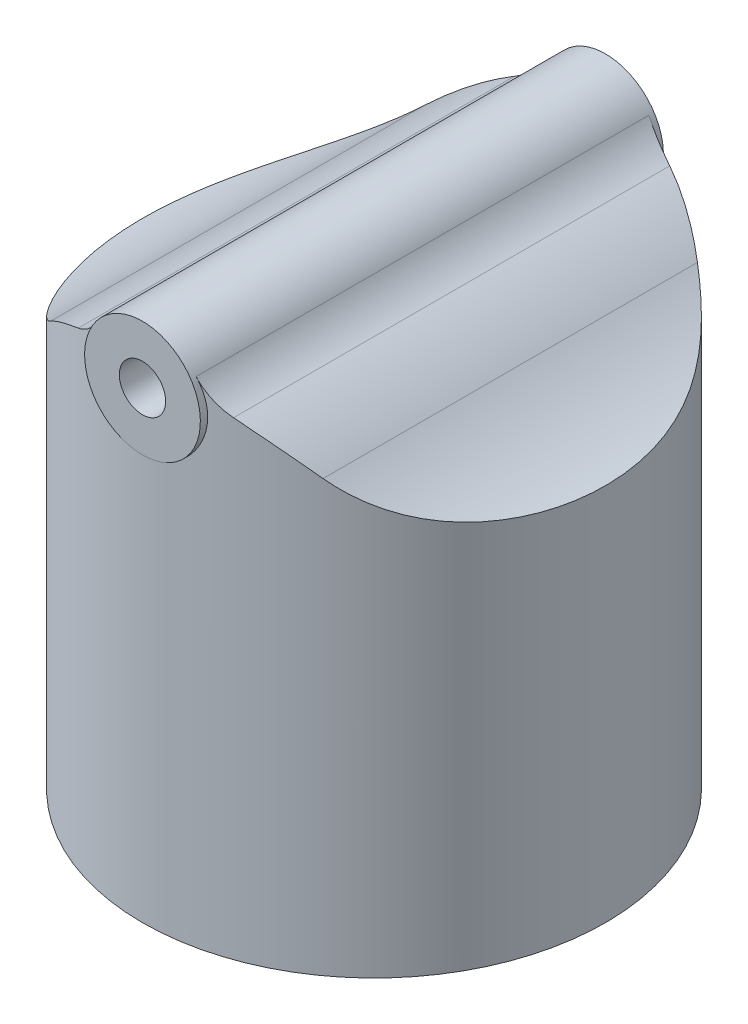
ISO-10303-21;
HEADER;
FILE_DESCRIPTION(('STEP AP214'),'2;1');
FILE_NAME('part.step','',(''),(''),'','','');
FILE_SCHEMA(('AUTOMOTIVE_DESIGN { 1 0 10303 214 1 1 1 1 }'));
ENDSEC;
DATA;
#1=APPLICATION_CONTEXT('core data for automotive mechanical design processes');
#2=APPLICATION_PROTOCOL_DEFINITION('international standard','automotive_design',2000,#1);
#3=PRODUCT_CONTEXT('',#1,'mechanical');
#4=PRODUCT('Part','Part','',(#3));
#5=PRODUCT_RELATED_PRODUCT_CATEGORY('part','',(#4));
#6=PRODUCT_DEFINITION_FORMATION('','',#4);
#7=PRODUCT_DEFINITION_CONTEXT('part definition',#1,'design');
#8=PRODUCT_DEFINITION('design','',#6,#7);
#9=PRODUCT_DEFINITION_SHAPE('','',#8);
#10=(LENGTH_UNIT() NAMED_UNIT(*) SI_UNIT(.MILLI.,.METRE.));
#11=(NAMED_UNIT(*) PLANE_ANGLE_UNIT() SI_UNIT($,.RADIAN.));
#12=(NAMED_UNIT(*) SI_UNIT($,.STERADIAN.) SOLID_ANGLE_UNIT());
#13=UNCERTAINTY_MEASURE_WITH_UNIT(LENGTH_MEASURE(1.E-05),#10,'distance_accuracy_value','');
#14=(GEOMETRIC_REPRESENTATION_CONTEXT(3) GLOBAL_UNCERTAINTY_ASSIGNED_CONTEXT((#13)) GLOBAL_UNIT_ASSIGNED_CONTEXT((#10,
#11,#12)) REPRESENTATION_CONTEXT('',''));
#15=CARTESIAN_POINT('',(0.,0.,0.));
#16=DIRECTION('',(0.,0.,1.));
#17=DIRECTION('',(1.,0.,0.));
#18=AXIS2_PLACEMENT_3D('',#15,#16,#17);
#19=CARTESIAN_POINT('',(0.,1000.,0.));
#20=DIRECTION('',(0.,-1.,0.));
#21=DIRECTION('',(0.,0.,-1.));
#22=AXIS2_PLACEMENT_3D('',#19,#20,#21);
#23=CYLINDRICAL_SURFACE('',#22,500.);
#24=CARTESIAN_POINT('',(230.488611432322,1000.,-443.705983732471));
#25=CARTESIAN_POINT('',(232.095030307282,997.858090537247,-442.871509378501));
#26=CARTESIAN_POINT('',(233.715258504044,995.733645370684,-442.018783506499));
#27=CARTESIAN_POINT('',(236.981944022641,991.520494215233,-440.276033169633));
#28=CARTESIAN_POINT('',(238.628401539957,989.431788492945,-439.386008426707));
#29=CARTESIAN_POINT('',(241.946216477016,985.290853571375,-437.56783101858));
#30=CARTESIAN_POINT('',(243.61757515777,983.238626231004,-436.639676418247));
#31=CARTESIAN_POINT('',(246.983583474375,979.171599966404,-434.744568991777));
#32=CARTESIAN_POINT('',(248.678233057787,977.15680095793,-433.777616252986));
#33=CARTESIAN_POINT('',(253.79551336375,971.168921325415,-430.817096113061));
#34=CARTESIAN_POINT('',(257.25102393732,967.252921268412,-428.764113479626));
#35=CARTESIAN_POINT('',(264.23617859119,959.579558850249,-424.494989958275));
#36=CARTESIAN_POINT('',(267.765821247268,955.822193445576,-422.27885220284));
#37=CARTESIAN_POINT('',(274.87476369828,948.482129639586,-417.686144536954));
#38=CARTESIAN_POINT('',(278.45387760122,944.898930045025,-415.310088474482));
#39=CARTESIAN_POINT('',(285.658024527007,937.899058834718,-410.388259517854));
#40=CARTESIAN_POINT('',(289.283057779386,934.482388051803,-407.842485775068));
#41=CARTESIAN_POINT('',(296.563687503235,927.819273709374,-402.579374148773));
#42=CARTESIAN_POINT('',(300.219279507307,924.572805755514,-399.862060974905));
#43=CARTESIAN_POINT('',(307.546340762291,918.251783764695,-394.25439825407));
#44=CARTESIAN_POINT('',(311.217809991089,915.177229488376,-391.364048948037));
#45=CARTESIAN_POINT('',(318.570465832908,909.193662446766,-385.402793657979));
#46=CARTESIAN_POINT('',(322.251653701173,906.285084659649,-382.331452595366));
#47=CARTESIAN_POINT('',(329.59902330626,900.641872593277,-376.015891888));
#48=CARTESIAN_POINT('',(333.265205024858,897.907238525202,-372.771672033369));
#49=CARTESIAN_POINT('',(340.567465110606,892.610659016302,-366.11230577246));
#50=CARTESIAN_POINT('',(344.203541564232,890.048724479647,-362.697148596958));
#51=CARTESIAN_POINT('',(351.430396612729,885.09554846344,-355.699276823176));
#52=CARTESIAN_POINT('',(355.021175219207,882.704306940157,-352.116562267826));
#53=CARTESIAN_POINT('',(362.141362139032,878.090361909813,-344.789381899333));
#54=CARTESIAN_POINT('',(365.670798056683,875.867580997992,-341.044991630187));
#55=CARTESIAN_POINT('',(372.656271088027,871.585167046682,-333.397844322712));
#56=CARTESIAN_POINT('',(376.112308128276,869.525534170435,-329.49508712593));
#57=CARTESIAN_POINT('',(382.937949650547,865.564457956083,-321.536944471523));
#58=CARTESIAN_POINT('',(386.307556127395,863.663010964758,-317.48156254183));
#59=CARTESIAN_POINT('',(392.948332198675,860.01253094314,-309.224317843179));
#60=CARTESIAN_POINT('',(396.219501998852,858.26349759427,-305.022455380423));
#61=CARTESIAN_POINT('',(402.602408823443,854.937499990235,-296.545131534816));
#62=CARTESIAN_POINT('',(405.715830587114,853.358290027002,-292.271818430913));
#63=CARTESIAN_POINT('',(411.826672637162,850.335038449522,-283.596443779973));
#64=CARTESIAN_POINT('',(414.824093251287,848.890996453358,-279.194382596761));
#65=CARTESIAN_POINT('',(420.693988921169,846.131368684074,-270.268568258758));
#66=CARTESIAN_POINT('',(423.566466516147,844.81578029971,-265.744817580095));
#67=CARTESIAN_POINT('',(429.178516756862,842.306112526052,-256.582659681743));
#68=CARTESIAN_POINT('',(431.918089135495,841.112033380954,-251.944252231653));
#69=CARTESIAN_POINT('',(437.258851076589,838.837675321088,-242.556957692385));
#70=CARTESIAN_POINT('',(439.859949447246,837.757470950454,-237.808000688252));
#71=CARTESIAN_POINT('',(444.915389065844,835.704811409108,-228.2098105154));
#72=CARTESIAN_POINT('',(447.369730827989,834.732355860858,-223.360577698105));
#73=CARTESIAN_POINT('',(452.126053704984,832.888338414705,-213.56886009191));
#74=CARTESIAN_POINT('',(454.428028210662,832.016780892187,-208.626371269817));
#75=CARTESIAN_POINT('',(458.87446847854,830.368007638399,-198.655532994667));
#76=CARTESIAN_POINT('',(461.018932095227,829.590793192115,-193.627182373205));
#77=CARTESIAN_POINT('',(465.356658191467,828.049510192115,-182.974168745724));
#78=CARTESIAN_POINT('',(467.532537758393,827.294890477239,-177.341051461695));
#79=CARTESIAN_POINT('',(471.682396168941,825.884625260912,-165.988684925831));
#80=CARTESIAN_POINT('',(473.656371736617,825.228981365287,-160.269434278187));
#81=CARTESIAN_POINT('',(477.398082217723,824.009283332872,-148.753907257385));
#82=CARTESIAN_POINT('',(479.165806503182,823.445233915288,-142.957626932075));
#83=CARTESIAN_POINT('',(482.49113573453,822.402068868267,-131.29759260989));
#84=CARTESIAN_POINT('',(484.048741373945,821.922952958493,-125.433838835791));
#85=CARTESIAN_POINT('',(486.951804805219,821.043334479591,-113.64342763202));
#86=CARTESIAN_POINT('',(488.29709889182,820.642892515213,-107.716725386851));
#87=CARTESIAN_POINT('',(490.771481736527,819.915854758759,-95.8138974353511));
#88=CARTESIAN_POINT('',(491.900570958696,819.58925880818,-89.837771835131));
#89=CARTESIAN_POINT('',(493.940423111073,819.005490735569,-77.8450669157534));
#90=CARTESIAN_POINT('',(494.851188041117,818.748317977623,-71.8284879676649));
#91=CARTESIAN_POINT('',(496.452756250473,818.299802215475,-59.7636471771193));
#92=CARTESIAN_POINT('',(497.143556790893,818.108460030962,-53.7153849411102));
#93=CARTESIAN_POINT('',(498.356145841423,817.774488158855,-41.0508620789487));
#94=CARTESIAN_POINT('',(498.857143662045,817.637787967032,-34.432444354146));
#95=CARTESIAN_POINT('',(499.595301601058,817.436960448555,-21.1797355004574));
#96=CARTESIAN_POINT('',(499.832456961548,817.372834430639,-14.5454440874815));
#97=CARTESIAN_POINT('',(500.042456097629,817.316032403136,-1.27094730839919));
#98=CARTESIAN_POINT('',(500.015243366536,817.323371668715,5.36925901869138));
#99=CARTESIAN_POINT('',(499.696426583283,817.40966481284,18.6427581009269));
#100=CARTESIAN_POINT('',(499.404826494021,817.488617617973,25.2760509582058));
#101=CARTESIAN_POINT('',(498.558774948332,817.71926231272,38.509922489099));
#102=CARTESIAN_POINT('',(498.004903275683,817.870793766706,45.1105410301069));
#103=CARTESIAN_POINT('',(496.635649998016,818.249141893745,58.2827362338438));
#104=CARTESIAN_POINT('',(495.820257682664,818.475961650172,64.8543116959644));
#105=CARTESIAN_POINT('',(493.930241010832,819.008550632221,77.9530772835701));
#106=CARTESIAN_POINT('',(492.855760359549,819.314276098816,84.4802899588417));
#107=CARTESIAN_POINT('',(490.449759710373,820.009698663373,97.4819429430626));
#108=CARTESIAN_POINT('',(489.118278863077,820.399382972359,103.956391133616));
#109=CARTESIAN_POINT('',(487.131112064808,820.991723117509,112.734276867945));
#110=CARTESIAN_POINT('',(486.585654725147,821.155261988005,115.065774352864));
#111=CARTESIAN_POINT('',(485.46158851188,821.494505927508,119.719567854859));
#112=CARTESIAN_POINT('',(484.882984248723,821.670209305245,122.041865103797));
#113=CARTESIAN_POINT('',(483.692689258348,822.034159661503,126.677182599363));
#114=CARTESIAN_POINT('',(483.080995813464,822.22240767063,128.990202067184));
#115=CARTESIAN_POINT('',(481.82468077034,822.611826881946,133.606514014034));
#116=CARTESIAN_POINT('',(481.180054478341,822.812999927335,135.909805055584));
#117=CARTESIAN_POINT('',(478.844782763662,823.547238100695,144.029018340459));
#118=CARTESIAN_POINT('',(477.06559418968,824.116296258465,149.816579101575));
#119=CARTESIAN_POINT('',(473.301235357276,825.346390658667,161.315047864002));
#120=CARTESIAN_POINT('',(471.316039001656,826.007438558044,167.025946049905));
#121=CARTESIAN_POINT('',(467.143283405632,827.429196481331,178.363834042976));
#122=CARTESIAN_POINT('',(464.955632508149,828.189951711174,183.990784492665));
#123=CARTESIAN_POINT('',(460.384030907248,829.818844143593,195.148381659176));
#124=CARTESIAN_POINT('',(458.000086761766,830.686977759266,200.679031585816));
#125=CARTESIAN_POINT('',(453.03709289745,832.540922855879,211.645182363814));
#126=CARTESIAN_POINT('',(450.457676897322,833.526957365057,217.080479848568));
#127=CARTESIAN_POINT('',(445.114741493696,835.624328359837,227.8352913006));
#128=CARTESIAN_POINT('',(442.351220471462,836.735665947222,233.154804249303));
#129=CARTESIAN_POINT('',(436.648467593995,839.092725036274,243.667540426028));
#130=CARTESIAN_POINT('',(433.709258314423,840.338429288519,248.860779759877));
#131=CARTESIAN_POINT('',(427.663928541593,842.973720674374,259.111889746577));
#132=CARTESIAN_POINT('',(424.557808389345,844.363307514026,264.169760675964));
#133=CARTESIAN_POINT('',(418.176147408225,847.301638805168,274.160509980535));
#134=CARTESIAN_POINT('',(414.899975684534,848.851000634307,279.092804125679));
#135=CARTESIAN_POINT('',(408.201454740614,852.113521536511,288.801583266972));
#136=CARTESIAN_POINT('',(404.77910533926,853.826680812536,293.57806807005));
#137=CARTESIAN_POINT('',(397.801067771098,857.425804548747,302.966201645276));
#138=CARTESIAN_POINT('',(394.245372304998,859.311778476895,307.577841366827));
#139=CARTESIAN_POINT('',(387.015193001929,863.264761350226,316.627196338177));
#140=CARTESIAN_POINT('',(383.340709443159,865.331769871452,321.064911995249));
#141=CARTESIAN_POINT('',(375.891963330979,869.652388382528,329.754378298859));
#142=CARTESIAN_POINT('',(372.117793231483,871.905829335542,334.006292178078));
#143=CARTESIAN_POINT('',(364.483356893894,876.60739194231,342.321103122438));
#144=CARTESIAN_POINT('',(360.623090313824,879.055514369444,346.383999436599));
#145=CARTESIAN_POINT('',(352.8348773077,884.151401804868,354.314029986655));
#146=CARTESIAN_POINT('',(348.906938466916,886.799144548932,358.181185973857));
#147=CARTESIAN_POINT('',(341.001875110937,892.298381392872,365.71509730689));
#148=CARTESIAN_POINT('',(337.02475150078,895.149871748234,369.38185633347));
#149=CARTESIAN_POINT('',(329.329959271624,900.845030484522,376.253140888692));
#150=CARTESIAN_POINT('',(325.614353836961,903.674317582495,379.471911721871));
#151=CARTESIAN_POINT('',(318.173600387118,909.510960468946,385.732028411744));
#152=CARTESIAN_POINT('',(314.448452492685,912.518314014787,388.773376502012));
#153=CARTESIAN_POINT('',(307.00427299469,918.710967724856,394.678287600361));
#154=CARTESIAN_POINT('',(303.285242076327,921.896286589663,397.54183185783));
#155=CARTESIAN_POINT('',(295.869698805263,928.442945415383,403.09126564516));
#156=CARTESIAN_POINT('',(292.173186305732,931.8042842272,405.777156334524));
#157=CARTESIAN_POINT('',(284.822795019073,938.696119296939,410.969828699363));
#158=CARTESIAN_POINT('',(281.168870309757,942.226407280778,413.476821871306));
#159=CARTESIAN_POINT('',(273.914173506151,949.45628530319,418.318113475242));
#160=CARTESIAN_POINT('',(270.31340347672,953.155881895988,420.6524052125));
#161=CARTESIAN_POINT('',(263.181544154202,960.717643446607,425.15084664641));
#162=CARTESIAN_POINT('',(259.650421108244,964.579726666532,427.315080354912));
#163=CARTESIAN_POINT('',(252.670139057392,972.462355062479,431.479216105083));
#164=CARTESIAN_POINT('',(249.220967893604,976.482876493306,433.479142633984));
#165=CARTESIAN_POINT('',(244.510885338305,982.155080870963,436.13837860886));
#166=CARTESIAN_POINT('',(243.209508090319,983.741995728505,436.865336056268));
#167=CARTESIAN_POINT('',(240.621614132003,986.937785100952,438.296046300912));
#168=CARTESIAN_POINT('',(239.335094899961,988.546655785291,438.999803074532));
#169=CARTESIAN_POINT('',(236.779355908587,991.783731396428,440.383520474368));
#170=CARTESIAN_POINT('',(235.510112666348,993.411902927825,441.06351590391));
#171=CARTESIAN_POINT('',(232.987351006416,996.689883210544,442.401325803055));
#172=CARTESIAN_POINT('',(231.733835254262,998.339695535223,443.05913654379));
#173=CARTESIAN_POINT('',(230.488611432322,1000.,443.705983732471));
#174=B_SPLINE_CURVE_WITH_KNOTS('',3,(#24,#25,#26,#27,#28,#29,#30,#31,#32,#33,#34,#35,#36,#37,
#38,#39,#40,#41,#42,#43,#44,#45,#46,#47,#48,#49,#50,#51,#52,#53,#54,#55,#56,#57,#58,#59,#60,#61,
#62,#63,#64,#65,#66,#67,#68,#69,#70,#71,#72,#73,#74,#75,#76,#77,#78,#79,#80,#81,#82,#83,#84,#85,
#86,#87,#88,#89,#90,#91,#92,#93,#94,#95,#96,#97,#98,#99,#100,#101,#102,#103,#104,#105,#106,#107,
#108,#109,#110,#111,#112,#113,#114,#115,#116,#117,#118,#119,#120,#121,#122,#123,#124,#125,#126,
#127,#128,#129,#130,#131,#132,#133,#134,#135,#136,#137,#138,#139,#140,#141,#142,#143,#144,#145,
#146,#147,#148,#149,#150,#151,#152,#153,#154,#155,#156,#157,#158,#159,#160,#161,#162,#163,#164,
#165,#166,#167,#168,#169,#170,#171,#172,#173),.UNSPECIFIED.,.F.,.F.,(4,2,2,2,2,2,2,2,2,2,2,2,2,
2,2,2,2,2,2,2,2,2,2,2,2,2,2,2,2,2,2,2,2,2,2,2,2,2,2,2,2,2,2,2,2,2,2,2,2,2,2,2,2,2,2,2,2,2,2,2,2,
2,2,2,2,2,2,2,2,2,2,2,2,2,4),(0.,8.41307748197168,16.8262176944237,25.2397854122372,
33.6533341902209,50.4827187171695,67.3117802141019,84.0891344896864,100.866572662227,
117.641599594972,134.416603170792,151.233721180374,168.050859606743,184.869058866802,
201.687253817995,218.497673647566,235.308110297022,252.118158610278,268.928171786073,
285.477794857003,302.027371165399,318.576610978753,335.125884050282,351.685924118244,
368.245906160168,384.806606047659,401.367531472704,419.619774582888,437.872313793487,
456.125793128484,474.379212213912,492.646637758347,510.914024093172,529.181243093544,
547.448689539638,567.359217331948,587.270104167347,607.185246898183,627.100091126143,
646.971115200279,666.842953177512,686.703794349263,706.561612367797,713.761515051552,
720.960418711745,728.159914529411,735.360439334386,753.599949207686,771.841772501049,
790.091895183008,808.341408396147,826.626006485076,844.910765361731,863.193179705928,
881.475556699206,899.831431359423,918.187328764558,936.54423243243,954.901093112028,
973.241488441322,991.581956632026,1009.92038227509,1028.25847097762,1045.26884738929,
1062.27900961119,1079.29096263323,1096.30280461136,1113.29418968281,1130.28623307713,
1147.26982860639,1164.25088840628,1170.78239099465,1177.3127682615,1183.83314118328,
1190.35460466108),.UNSPECIFIED.);
#175=CARTESIAN_POINT('',(294.266233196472,929.926341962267,-404.236791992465));
#176=VERTEX_POINT('',#175);
#177=CARTESIAN_POINT('',(294.266233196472,929.926341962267,404.236791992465));
#178=VERTEX_POINT('',#177);
#179=EDGE_CURVE('E180',#176,#178,#174,.T.);
#180=ORIENTED_EDGE('',*,*,#179,.T.);
#181=CARTESIAN_POINT('',(294.266233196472,929.926341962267,404.236791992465));
#182=CARTESIAN_POINT('',(291.995633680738,931.989237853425,405.889683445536));
#183=CARTESIAN_POINT('',(289.701325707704,934.035543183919,407.530570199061));
#184=CARTESIAN_POINT('',(285.065058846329,938.094175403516,410.786974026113));
#185=CARTESIAN_POINT('',(282.723099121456,940.106501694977,412.40249065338));
#186=CARTESIAN_POINT('',(275.625128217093,946.091531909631,417.209118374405));
#187=CARTESIAN_POINT('',(270.797393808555,950.011952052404,420.360038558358));
#188=CARTESIAN_POINT('',(260.985194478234,957.678072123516,426.520874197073));
#189=CARTESIAN_POINT('',(256.002043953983,961.424792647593,429.531613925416));
#190=CARTESIAN_POINT('',(245.848209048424,968.763297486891,435.422907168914));
#191=CARTESIAN_POINT('',(240.677529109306,972.355085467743,438.303463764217));
#192=CARTESIAN_POINT('',(230.148333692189,979.375271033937,443.922701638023));
#193=CARTESIAN_POINT('',(224.789757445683,982.803614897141,446.661336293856));
#194=CARTESIAN_POINT('',(213.889253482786,989.485081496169,451.982489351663));
#195=CARTESIAN_POINT('',(208.347333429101,992.738211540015,454.565014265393));
#196=CARTESIAN_POINT('',(197.044631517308,999.080307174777,459.577948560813));
#197=CARTESIAN_POINT('',(191.282604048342,1002.16798615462,462.007186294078));
#198=CARTESIAN_POINT('',(182.506906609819,1006.64920679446,465.511714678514));
#199=CARTESIAN_POINT('',(179.559176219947,1008.11807702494,466.656808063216));
#200=CARTESIAN_POINT('',(173.620319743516,1011.00419669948,468.898772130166));
#201=CARTESIAN_POINT('',(170.629192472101,1012.42144473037,469.995641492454));
#202=CARTESIAN_POINT('',(167.616744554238,1013.81215782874,471.06753968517));
#203=B_SPLINE_CURVE_WITH_KNOTS('',3,(#181,#182,#183,#184,#185,#186,#187,#188,#189,#190,#191,
#192,#193,#194,#195,#196,#197,#198,#199,#200,#201,#202),.UNSPECIFIED.,.F.,.F.,(4,2,2,2,2,2,2,2,
2,2,4),(0.,10.4538459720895,20.9078756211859,41.8176317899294,62.582819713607,83.347516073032,
104.118991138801,124.889599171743,145.803424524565,156.263034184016,166.722929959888),.UNSPECIFIED.);
#204=CARTESIAN_POINT('',(167.616744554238,1013.81215782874,471.06753968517));
#205=VERTEX_POINT('',#204);
#206=EDGE_CURVE('E209',#178,#205,#203,.T.);
#207=ORIENTED_EDGE('',*,*,#206,.T.);
#208=CARTESIAN_POINT('',(230.488611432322,1000.,443.705983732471));
#209=CARTESIAN_POINT('',(228.467256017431,999.999982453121,444.756038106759));
#210=CARTESIAN_POINT('',(226.438635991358,1000.0408590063,445.792254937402));
#211=CARTESIAN_POINT('',(222.370011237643,1000.206032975,447.83563080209));
#212=CARTESIAN_POINT('',(220.330005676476,1000.33033657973,448.842787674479));
#213=CARTESIAN_POINT('',(216.240933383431,1000.66408937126,450.827049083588));
#214=CARTESIAN_POINT('',(214.191862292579,1000.87358525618,451.804136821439));
#215=CARTESIAN_POINT('',(210.089431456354,1001.37919177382,453.726306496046));
#216=CARTESIAN_POINT('',(208.036071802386,1001.6753005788,454.671389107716));
#217=CARTESIAN_POINT('',(203.925149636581,1002.35606659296,456.529989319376));
#218=CARTESIAN_POINT('',(201.867586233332,1002.74088279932,457.443446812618));
#219=CARTESIAN_POINT('',(197.75608910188,1003.59988917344,459.235841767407));
#220=CARTESIAN_POINT('',(195.702155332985,1004.07407833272,460.114779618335));
#221=CARTESIAN_POINT('',(191.602568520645,1005.11264327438,461.836982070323));
#222=CARTESIAN_POINT('',(189.55691409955,1005.67700336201,462.680252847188));
#223=CARTESIAN_POINT('',(185.478045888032,1006.89661049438,464.330415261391));
#224=CARTESIAN_POINT('',(183.444832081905,1007.55185742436,465.137306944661));
#225=CARTESIAN_POINT('',(179.386589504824,1008.95669335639,466.717488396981));
#226=CARTESIAN_POINT('',(177.36163650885,1009.70668612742,467.490614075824));
#227=CARTESIAN_POINT('',(173.33390374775,1011.29877901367,468.998914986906));
#228=CARTESIAN_POINT('',(171.331124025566,1012.14087930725,469.734090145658));
#229=CARTESIAN_POINT('',(167.352553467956,1013.91699402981,471.166205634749));
#230=CARTESIAN_POINT('',(165.376765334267,1014.85101758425,471.863142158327));
#231=CARTESIAN_POINT('',(161.457472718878,1016.81027923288,473.218537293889));
#232=CARTESIAN_POINT('',(159.513968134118,1017.83551703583,473.876996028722));
#233=CARTESIAN_POINT('',(155.66840583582,1019.9739757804,475.15412630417));
#234=CARTESIAN_POINT('',(153.766269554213,1021.08700715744,475.772878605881));
#235=CARTESIAN_POINT('',(150.0043005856,1023.40160691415,476.972334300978));
#236=CARTESIAN_POINT('',(148.144468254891,1024.60317603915,477.553037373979));
#237=CARTESIAN_POINT('',(144.472412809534,1027.09298728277,478.676726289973));
#238=CARTESIAN_POINT('',(142.660183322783,1028.38121771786,479.219717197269));
#239=CARTESIAN_POINT('',(139.088054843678,1031.0424512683,480.26865182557));
#240=CARTESIAN_POINT('',(137.328154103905,1032.41545154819,480.77459678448));
#241=CARTESIAN_POINT('',(134.118305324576,1035.03735736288,481.678980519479));
#242=CARTESIAN_POINT('',(132.660617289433,1036.27511513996,482.08233066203));
#243=CARTESIAN_POINT('',(129.789665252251,1038.80922518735,482.863185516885));
#244=CARTESIAN_POINT('',(128.376405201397,1040.10558264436,483.240687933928));
#245=CARTESIAN_POINT('',(125.597437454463,1042.75482957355,483.970399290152));
#246=CARTESIAN_POINT('',(124.231724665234,1044.10771295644,484.322610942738));
#247=CARTESIAN_POINT('',(121.550536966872,1046.86805720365,485.002453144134));
#248=CARTESIAN_POINT('',(120.235057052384,1048.27551260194,485.330086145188));
#249=CARTESIAN_POINT('',(117.651811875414,1051.14858147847,485.96278298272));
#250=CARTESIAN_POINT('',(116.384250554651,1052.6143986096,486.267754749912));
#251=CARTESIAN_POINT('',(113.904734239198,1055.59681961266,486.854531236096));
#252=CARTESIAN_POINT('',(112.692779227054,1057.11342346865,487.136335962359));
#253=CARTESIAN_POINT('',(110.326627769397,1060.19536747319,487.677668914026));
#254=CARTESIAN_POINT('',(109.172442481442,1061.76071694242,487.93719284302));
#255=CARTESIAN_POINT('',(106.924284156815,1064.93740029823,488.434767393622));
#256=CARTESIAN_POINT('',(105.830311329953,1066.54873434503,488.672817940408));
#257=CARTESIAN_POINT('',(104.767550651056,1068.18181818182,488.900562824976));
#258=B_SPLINE_CURVE_WITH_KNOTS('',3,(#208,#209,#210,#211,#212,#213,#214,#215,#216,#217,#218,
#219,#220,#221,#222,#223,#224,#225,#226,#227,#228,#229,#230,#231,#232,#233,#234,#235,#236,#237,
#238,#239,#240,#241,#242,#243,#244,#245,#246,#247,#248,#249,#250,#251,#252,#253,#254,#255,#256,
#257),.UNSPECIFIED.,.F.,.F.,(4,2,2,2,2,2,2,2,2,2,2,2,2,2,2,2,2,2,2,2,2,2,2,2,4),(0.,
6.83315831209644,13.6668236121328,20.5042398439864,27.3415118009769,34.1911353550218,
41.0406816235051,47.8890369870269,54.7373837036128,61.6159674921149,68.4945645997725,
75.3738452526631,82.2531039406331,89.117895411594,95.9827446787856,102.846670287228,
109.710366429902,115.57199475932,121.434142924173,127.295661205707,133.156593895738,
139.040166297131,144.923736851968,150.808439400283,156.693162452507),.UNSPECIFIED.);
#259=CARTESIAN_POINT('',(104.767550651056,1068.18181818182,488.900562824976));
#260=VERTEX_POINT('',#259);
#261=EDGE_CURVE('E143',#205,#260,#258,.T.);
#262=ORIENTED_EDGE('',*,*,#261,.T.);
#263=CARTESIAN_POINT('',(-104.767550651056,1068.18181818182,488.900562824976));
#264=CARTESIAN_POINT('',(-105.706335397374,1066.73932456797,488.699383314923));
#265=CARTESIAN_POINT('',(-106.615527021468,1065.27706962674,488.501727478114));
#266=CARTESIAN_POINT('',(-108.373217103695,1062.3154062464,488.114799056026));
#267=CARTESIAN_POINT('',(-109.221714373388,1060.81599708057,487.925526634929));
#268=CARTESIAN_POINT('',(-110.856733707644,1057.78196534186,487.556649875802));
#269=CARTESIAN_POINT('',(-111.643235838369,1056.24733164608,487.377048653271));
#270=CARTESIAN_POINT('',(-113.152525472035,1053.14583860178,487.028855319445));
#271=CARTESIAN_POINT('',(-113.875313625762,1051.57897958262,486.860263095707));
#272=CARTESIAN_POINT('',(-115.254163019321,1048.41943515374,486.535690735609));
#273=CARTESIAN_POINT('',(-115.910381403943,1046.82682136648,486.379681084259));
#274=CARTESIAN_POINT('',(-117.156823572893,1043.61475073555,486.080949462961));
#275=CARTESIAN_POINT('',(-117.747047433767,1041.99529392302,485.9382274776));
#276=CARTESIAN_POINT('',(-118.860208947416,1038.73268281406,485.667148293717));
#277=CARTESIAN_POINT('',(-119.383163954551,1037.08953475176,485.538787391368));
#278=CARTESIAN_POINT('',(-120.360886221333,1033.78211264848,485.297342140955));
#279=CARTESIAN_POINT('',(-120.815656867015,1032.11783966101,485.184257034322));
#280=CARTESIAN_POINT('',(-121.859298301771,1027.96177973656,484.923423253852));
#281=CARTESIAN_POINT('',(-122.406735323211,1025.45884432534,484.785340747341));
#282=CARTESIAN_POINT('',(-123.346951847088,1020.42279952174,484.546968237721));
#283=CARTESIAN_POINT('',(-123.739754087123,1017.88969462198,484.446672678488));
#284=CARTESIAN_POINT('',(-124.369061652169,1012.80257724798,484.285496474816));
#285=CARTESIAN_POINT('',(-124.605547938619,1010.24856226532,484.224620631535));
#286=CARTESIAN_POINT('',(-124.921026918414,1005.12961838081,484.143330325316));
#287=CARTESIAN_POINT('',(-124.99999276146,1002.56468769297,484.122922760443));
#288=CARTESIAN_POINT('',(-125.00000487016,998.274453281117,484.122915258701));
#289=CARTESIAN_POINT('',(-124.964267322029,996.549016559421,484.132148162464));
#290=CARTESIAN_POINT('',(-124.821402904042,993.101154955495,484.169002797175));
#291=CARTESIAN_POINT('',(-124.714272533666,991.3787302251,484.196625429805));
#292=CARTESIAN_POINT('',(-124.42882244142,987.939920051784,484.270058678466));
#293=CARTESIAN_POINT('',(-124.250491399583,986.223535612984,484.315872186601));
#294=CARTESIAN_POINT('',(-123.823024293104,982.800170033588,484.425337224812));
#295=CARTESIAN_POINT('',(-123.573887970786,981.093188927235,484.488988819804));
#296=CARTESIAN_POINT('',(-123.005110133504,977.690337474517,484.633706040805));
#297=CARTESIAN_POINT('',(-122.685411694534,975.994477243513,484.714785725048));
#298=CARTESIAN_POINT('',(-121.976297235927,972.618285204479,484.893716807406));
#299=CARTESIAN_POINT('',(-121.586880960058,970.937953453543,484.991568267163));
#300=CARTESIAN_POINT('',(-120.739176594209,967.595943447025,485.203299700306));
#301=CARTESIAN_POINT('',(-120.280894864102,965.934263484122,485.3171781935));
#302=CARTESIAN_POINT('',(-119.296320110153,962.632144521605,485.560135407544));
#303=CARTESIAN_POINT('',(-118.770021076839,960.991707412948,485.689215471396));
#304=CARTESIAN_POINT('',(-117.651335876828,957.737498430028,485.961412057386));
#305=CARTESIAN_POINT('',(-117.059050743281,956.12369001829,486.104507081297));
#306=CARTESIAN_POINT('',(-115.808839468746,952.922773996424,486.403871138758));
#307=CARTESIAN_POINT('',(-115.150907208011,951.335668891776,486.560141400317));
#308=CARTESIAN_POINT('',(-113.770753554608,948.191084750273,486.884707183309));
#309=CARTESIAN_POINT('',(-113.048537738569,946.633603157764,487.053001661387));
#310=CARTESIAN_POINT('',(-111.541033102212,943.550529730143,487.400447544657));
#311=CARTESIAN_POINT('',(-110.755738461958,942.024940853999,487.579599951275));
#312=CARTESIAN_POINT('',(-109.123696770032,939.008534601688,487.947454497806));
#313=CARTESIAN_POINT('',(-108.276960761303,937.517711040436,488.136154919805));
#314=CARTESIAN_POINT('',(-106.523322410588,934.572796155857,488.521839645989));
#315=CARTESIAN_POINT('',(-105.616414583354,933.118708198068,488.718824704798));
#316=CARTESIAN_POINT('',(-103.744147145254,930.249834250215,489.119687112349));
#317=CARTESIAN_POINT('',(-102.778792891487,928.835044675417,489.323563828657));
#318=CARTESIAN_POINT('',(-100.791071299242,926.046691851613,489.73685840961));
#319=CARTESIAN_POINT('',(-99.7686974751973,924.673133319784,489.946276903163));
#320=CARTESIAN_POINT('',(-97.6478351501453,921.94266343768,490.373422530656));
#321=CARTESIAN_POINT('',(-96.5482372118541,920.586626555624,490.591232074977));
#322=CARTESIAN_POINT('',(-94.2935770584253,917.922191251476,491.029571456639));
#323=CARTESIAN_POINT('',(-93.1385208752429,916.613787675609,491.250100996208));
#324=CARTESIAN_POINT('',(-90.7746204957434,914.046446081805,491.692398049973));
#325=CARTESIAN_POINT('',(-89.5657702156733,912.7875136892,491.914165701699));
#326=CARTESIAN_POINT('',(-87.0965096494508,910.321449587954,492.357361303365));
#327=CARTESIAN_POINT('',(-85.8361041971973,909.114313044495,492.578789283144));
#328=CARTESIAN_POINT('',(-83.2654194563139,906.753466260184,493.019848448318));
#329=CARTESIAN_POINT('',(-81.9551298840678,905.599767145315,493.239479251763));
#330=CARTESIAN_POINT('',(-79.2871776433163,903.348097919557,493.67536928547));
#331=CARTESIAN_POINT('',(-77.9295193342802,902.250122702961,493.891628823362));
#332=CARTESIAN_POINT('',(-75.1687917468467,900.111553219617,494.319334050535));
#333=CARTESIAN_POINT('',(-73.7657181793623,899.070964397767,494.530779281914));
#334=CARTESIAN_POINT('',(-70.9166932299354,897.049169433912,494.947365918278));
#335=CARTESIAN_POINT('',(-69.4707455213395,896.067958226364,495.152507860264));
#336=CARTESIAN_POINT('',(-66.5176390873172,894.15320620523,495.557923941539));
#337=CARTESIAN_POINT('',(-65.0099060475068,893.220527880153,495.758089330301));
#338=CARTESIAN_POINT('',(-61.9552374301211,891.419651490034,496.14908996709));
#339=CARTESIAN_POINT('',(-60.4083020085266,890.55145316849,496.339925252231));
#340=CARTESIAN_POINT('',(-57.2778455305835,888.881163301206,496.710914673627));
#341=CARTESIAN_POINT('',(-55.694323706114,888.079073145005,496.891068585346));
#342=CARTESIAN_POINT('',(-52.4934920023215,886.542585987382,497.239404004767));
#343=CARTESIAN_POINT('',(-50.8761823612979,885.808188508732,497.40758559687));
#344=CARTESIAN_POINT('',(-47.6107250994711,884.408589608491,497.730761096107));
#345=CARTESIAN_POINT('',(-45.96257953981,883.743383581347,497.885755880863));
#346=CARTESIAN_POINT('',(-42.6384496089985,882.483526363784,498.181439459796));
#347=CARTESIAN_POINT('',(-40.9624678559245,881.888868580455,498.322129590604));
#348=CARTESIAN_POINT('',(-37.5855089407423,880.771258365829,498.588205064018));
#349=CARTESIAN_POINT('',(-35.8845310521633,880.248308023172,498.713589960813));
#350=CARTESIAN_POINT('',(-32.4607634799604,879.275246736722,498.948136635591));
#351=CARTESIAN_POINT('',(-30.737973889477,878.825135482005,499.057298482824));
#352=CARTESIAN_POINT('',(-27.3088923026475,878.007098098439,499.256561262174));
#353=CARTESIAN_POINT('',(-25.6029731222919,877.637691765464,499.34700353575));
#354=CARTESIAN_POINT('',(-22.1763743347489,876.970511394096,499.510911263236));
#355=CARTESIAN_POINT('',(-20.455694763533,876.672737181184,499.584376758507));
#356=CARTESIAN_POINT('',(-17.0027421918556,876.149461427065,499.713809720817));
#357=CARTESIAN_POINT('',(-15.2704693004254,875.923959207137,499.769777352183));
#358=CARTESIAN_POINT('',(-11.7975117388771,875.545711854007,499.863817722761));
#359=CARTESIAN_POINT('',(-10.0568270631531,875.3929667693,499.901890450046));
#360=CARTESIAN_POINT('',(-6.57049926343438,875.160582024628,499.959866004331));
#361=CARTESIAN_POINT('',(-4.82485678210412,875.080933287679,499.979771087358));
#362=CARTESIAN_POINT('',(-1.33165756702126,874.994883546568,500.001277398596));
#363=CARTESIAN_POINT('',(0.41589916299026,874.98848239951,500.002878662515));
#364=CARTESIAN_POINT('',(3.90964783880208,875.048941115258,499.987766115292));
#365=CARTESIAN_POINT('',(5.65583979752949,875.115800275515,499.971052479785));
#366=CARTESIAN_POINT('',(9.14361315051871,875.32263178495,499.919429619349));
#367=CARTESIAN_POINT('',(10.885194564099,875.462603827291,499.884520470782));
#368=CARTESIAN_POINT('',(14.3217884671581,875.811423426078,499.797733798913));
#369=CARTESIAN_POINT('',(16.0169740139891,876.018667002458,499.746251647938));
#370=CARTESIAN_POINT('',(19.3969966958,876.502342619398,499.626476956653));
#371=CARTESIAN_POINT('',(21.0818329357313,876.778780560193,499.5581829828));
#372=CARTESIAN_POINT('',(24.4379429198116,877.400247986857,499.405254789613));
#373=CARTESIAN_POINT('',(26.1092175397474,877.745273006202,499.320621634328));
#374=CARTESIAN_POINT('',(29.4354231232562,878.503228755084,499.135583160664));
#375=CARTESIAN_POINT('',(31.0903539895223,878.916159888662,499.035177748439));
#376=CARTESIAN_POINT('',(34.3810667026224,879.809114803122,498.819267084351));
#377=CARTESIAN_POINT('',(36.0168479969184,880.289140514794,498.703761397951));
#378=CARTESIAN_POINT('',(39.2664475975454,881.315336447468,498.458424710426));
#379=CARTESIAN_POINT('',(40.8802657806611,881.86150703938,498.328593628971));
#380=CARTESIAN_POINT('',(44.0831730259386,883.018918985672,498.055475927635));
#381=CARTESIAN_POINT('',(45.6722629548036,883.630158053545,497.912189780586));
#382=CARTESIAN_POINT('',(48.8232849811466,884.916625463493,497.613094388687));
#383=CARTESIAN_POINT('',(50.3852147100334,885.591859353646,497.457284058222));
#384=CARTESIAN_POINT('',(53.4930915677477,887.011355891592,497.132730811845));
#385=CARTESIAN_POINT('',(55.0387702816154,887.75618259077,496.963884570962));
#386=CARTESIAN_POINT('',(58.0973640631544,889.308366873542,496.615611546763));
#387=CARTESIAN_POINT('',(59.6102760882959,890.115730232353,496.436183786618));
#388=CARTESIAN_POINT('',(62.6006124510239,891.791402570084,496.067971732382));
#389=CARTESIAN_POINT('',(64.0780399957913,892.659706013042,495.879188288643));
#390=CARTESIAN_POINT('',(66.9953234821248,894.455880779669,495.493483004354));
#391=CARTESIAN_POINT('',(68.4351760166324,895.38375747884,495.296560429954));
#392=CARTESIAN_POINT('',(71.2748891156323,897.297411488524,494.895894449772));
#393=CARTESIAN_POINT('',(72.6747498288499,898.283188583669,494.692151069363));
#394=CARTESIAN_POINT('',(75.4324003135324,900.3110714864,494.279169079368));
#395=CARTESIAN_POINT('',(76.7901866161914,901.353181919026,494.069930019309));
#396=CARTESIAN_POINT('',(79.4614094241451,903.49190849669,493.647356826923));
#397=CARTESIAN_POINT('',(80.7748471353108,904.588523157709,493.43402280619));
#398=CARTESIAN_POINT('',(83.3553624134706,906.834504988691,493.004659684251));
#399=CARTESIAN_POINT('',(84.6224398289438,907.983872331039,492.788630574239));
#400=CARTESIAN_POINT('',(87.1417835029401,910.365216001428,492.349457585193));
#401=CARTESIAN_POINT('',(88.3927283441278,911.598584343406,492.126278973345));
#402=CARTESIAN_POINT('',(90.8414516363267,914.116853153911,491.680159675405));
#403=CARTESIAN_POINT('',(92.0392344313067,915.401749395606,491.457218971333));
#404=CARTESIAN_POINT('',(94.3798745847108,918.021193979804,491.013093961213));
#405=CARTESIAN_POINT('',(95.5227256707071,919.355747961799,490.791909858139));
#406=CARTESIAN_POINT('',(97.7513142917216,922.072043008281,490.352903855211));
#407=CARTESIAN_POINT('',(98.837057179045,923.453779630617,490.13508164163));
#408=CARTESIAN_POINT('',(100.950247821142,926.26304512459,489.704207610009));
#409=CARTESIAN_POINT('',(101.977663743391,927.690598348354,489.491158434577));
#410=CARTESIAN_POINT('',(103.971668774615,930.588293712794,489.071497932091));
#411=CARTESIAN_POINT('',(104.938263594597,932.058431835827,488.864886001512));
#412=CARTESIAN_POINT('',(106.809062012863,935.03908474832,488.459558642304));
#413=CARTESIAN_POINT('',(107.713261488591,936.549602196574,488.260843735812));
#414=CARTESIAN_POINT('',(109.457458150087,939.608246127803,487.87279390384));
#415=CARTESIAN_POINT('',(110.297461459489,941.156369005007,487.683458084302));
#416=CARTESIAN_POINT('',(111.916373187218,944.296645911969,487.314496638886));
#417=CARTESIAN_POINT('',(112.694907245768,945.889000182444,487.134932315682));
#418=CARTESIAN_POINT('',(114.183959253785,949.106333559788,486.788052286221));
#419=CARTESIAN_POINT('',(114.894483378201,950.731309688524,486.620735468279));
#420=CARTESIAN_POINT('',(116.246294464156,954.01145531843,486.299580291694));
#421=CARTESIAN_POINT('',(116.88756942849,955.666629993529,486.145744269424));
#422=CARTESIAN_POINT('',(118.099422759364,959.003928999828,485.852770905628));
#423=CARTESIAN_POINT('',(118.670001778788,960.686053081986,485.713633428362));
#424=CARTESIAN_POINT('',(119.738282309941,964.071072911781,485.45138348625));
#425=CARTESIAN_POINT('',(120.236116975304,965.773924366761,485.328241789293));
#426=CARTESIAN_POINT('',(121.159099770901,969.200316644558,485.098648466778));
#427=CARTESIAN_POINT('',(121.584248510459,970.92385729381,484.99219670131));
#428=CARTESIAN_POINT('',(122.360780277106,974.38772592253,484.796864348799));
#429=CARTESIAN_POINT('',(122.712193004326,976.128046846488,484.707976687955));
#430=CARTESIAN_POINT('',(123.340654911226,979.622704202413,484.548437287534));
#431=CARTESIAN_POINT('',(123.617713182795,981.377038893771,484.477783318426));
#432=CARTESIAN_POINT('',(124.047420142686,984.53313762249,484.3679136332));
#433=CARTESIAN_POINT('',(124.213944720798,985.93290992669,484.325218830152));
#434=CARTESIAN_POINT('',(124.499546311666,988.737278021,484.251881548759));
#435=CARTESIAN_POINT('',(124.618634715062,990.141872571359,484.22123617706));
#436=CARTESIAN_POINT('',(124.809236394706,992.954367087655,484.172143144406));
#437=CARTESIAN_POINT('',(124.880754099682,994.362266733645,484.153694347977));
#438=CARTESIAN_POINT('',(124.976141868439,997.180101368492,484.129080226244));
#439=CARTESIAN_POINT('',(125.00000082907,998.590036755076,484.122917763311));
#440=CARTESIAN_POINT('',(124.999998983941,1001.72796726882,484.122918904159));
#441=CARTESIAN_POINT('',(124.964161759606,1003.45597637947,484.132176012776));
#442=CARTESIAN_POINT('',(124.820880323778,1006.9090007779,484.169136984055));
#443=CARTESIAN_POINT('',(124.713427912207,1008.63401570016,484.196842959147));
#444=CARTESIAN_POINT('',(124.427091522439,1012.07833752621,484.27050371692));
#445=CARTESIAN_POINT('',(124.248182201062,1013.79764218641,484.316464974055));
#446=CARTESIAN_POINT('',(123.819292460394,1017.22699343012,484.426291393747));
#447=CARTESIAN_POINT('',(123.569303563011,1018.93703888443,484.490158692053));
#448=CARTESIAN_POINT('',(122.998208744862,1022.34809024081,484.635458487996));
#449=CARTESIAN_POINT('',(122.676957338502,1024.04907025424,484.716926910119));
#450=CARTESIAN_POINT('',(121.96435706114,1027.43517285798,484.89672155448));
#451=CARTESIAN_POINT('',(121.573016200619,1029.12029723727,484.995045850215));
#452=CARTESIAN_POINT('',(120.721105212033,1032.47157502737,485.207798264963));
#453=CARTESIAN_POINT('',(120.260549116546,1034.13773221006,485.322223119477));
#454=CARTESIAN_POINT('',(119.271143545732,1037.44835729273,485.566322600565));
#455=CARTESIAN_POINT('',(118.742297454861,1039.09282626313,485.695996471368));
#456=CARTESIAN_POINT('',(117.345071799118,1043.14737553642,486.035876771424));
#457=CARTESIAN_POINT('',(116.436214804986,1045.54292208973,486.254691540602));
#458=CARTESIAN_POINT('',(114.474407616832,1050.27087886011,486.720274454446));
#459=CARTESIAN_POINT('',(113.421477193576,1052.60329768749,486.967038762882));
#460=CARTESIAN_POINT('',(111.17925854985,1057.18973297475,487.483837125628));
#461=CARTESIAN_POINT('',(109.990423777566,1059.44397923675,487.753793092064));
#462=CARTESIAN_POINT('',(108.106569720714,1062.76616549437,488.173517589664));
#463=CARTESIAN_POINT('',(107.461775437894,1063.86381375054,488.31590721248));
#464=CARTESIAN_POINT('',(106.139237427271,1066.03848531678,488.605075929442));
#465=CARTESIAN_POINT('',(105.461493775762,1067.1155086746,488.751855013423));
#466=CARTESIAN_POINT('',(104.767550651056,1068.18181818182,488.900562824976));
#467=B_SPLINE_CURVE_WITH_KNOTS('',3,(#263,#264,#265,#266,#267,#268,#269,#270,#271,#272,#273,
#274,#275,#276,#277,#278,#279,#280,#281,#282,#283,#284,#285,#286,#287,#288,#289,#290,#291,#292,
#293,#294,#295,#296,#297,#298,#299,#300,#301,#302,#303,#304,#305,#306,#307,#308,#309,#310,#311,
#312,#313,#314,#315,#316,#317,#318,#319,#320,#321,#322,#323,#324,#325,#326,#327,#328,#329,#330,
#331,#332,#333,#334,#335,#336,#337,#338,#339,#340,#341,#342,#343,#344,#345,#346,#347,#348,#349,
#350,#351,#352,#353,#354,#355,#356,#357,#358,#359,#360,#361,#362,#363,#364,#365,#366,#367,#368,
#369,#370,#371,#372,#373,#374,#375,#376,#377,#378,#379,#380,#381,#382,#383,#384,#385,#386,#387,
#388,#389,#390,#391,#392,#393,#394,#395,#396,#397,#398,#399,#400,#401,#402,#403,#404,#405,#406,
#407,#408,#409,#410,#411,#412,#413,#414,#415,#416,#417,#418,#419,#420,#421,#422,#423,#424,#425,
#426,#427,#428,#429,#430,#431,#432,#433,#434,#435,#436,#437,#438,#439,#440,#441,#442,#443,#444,
#445,#446,#447,#448,#449,#450,#451,#452,#453,#454,#455,#456,#457,#458,#459,#460,#461,#462,#463,
#464,#465,#466),.UNSPECIFIED.,.F.,.F.,(4,2,2,2,2,2,2,2,2,2,2,2,2,2,2,2,2,2,2,2,2,2,2,2,2,2,2,2,
2,2,2,2,2,2,2,2,2,2,2,2,2,2,2,2,2,2,2,2,2,2,2,2,2,2,2,2,2,2,2,2,2,2,2,2,2,2,2,2,2,2,2,2,2,2,2,2,
2,2,2,2,2,2,2,2,2,2,2,2,2,2,2,2,2,2,2,2,2,2,2,2,2,4),(0.,5.19802958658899,10.3961609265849,
15.5959569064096,20.7956997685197,25.9828675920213,31.170029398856,36.3558502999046,
41.5414135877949,49.2334913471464,56.9244376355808,64.6163204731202,72.3095143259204,
77.4855696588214,82.6618788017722,87.8390112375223,93.0161625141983,98.197505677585,
103.378867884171,108.559751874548,113.741093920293,118.914608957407,124.088606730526,
129.262156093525,134.436183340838,139.609282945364,144.782854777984,149.955953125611,
155.129641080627,160.406230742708,165.682247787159,170.958863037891,176.234984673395,
181.512199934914,186.788930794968,192.066161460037,197.342941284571,202.693791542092,
208.044620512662,213.395561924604,218.746465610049,224.097012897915,229.447059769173,
234.797262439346,240.147442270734,245.389236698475,250.631018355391,255.872750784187,
261.114486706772,266.35557163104,271.596646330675,276.837670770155,282.078673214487,
287.202909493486,292.327582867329,297.45192262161,302.576292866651,307.700810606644,
312.825357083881,317.949723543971,323.074534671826,328.245242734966,333.416428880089,
338.587145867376,343.758330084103,348.929495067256,354.101085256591,359.272534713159,
364.444001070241,369.754961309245,375.065486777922,380.376617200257,385.68724896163,
391.000751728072,396.313754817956,401.627108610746,406.939954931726,412.282996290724,
417.625552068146,422.969031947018,428.312462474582,433.645986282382,438.979465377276,
444.310792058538,449.641466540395,453.871517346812,458.10055179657,462.32919247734,
466.558818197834,471.742396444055,476.926568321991,482.112580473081,487.299211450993,
492.49653024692,497.693255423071,502.888928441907,508.084344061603,515.793478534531,
523.501556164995,531.184627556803,535.027002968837,538.869369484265),.UNSPECIFIED.);
#468=CARTESIAN_POINT('',(0.,875.,500.));
#469=VERTEX_POINT('',#468);
#470=EDGE_CURVE('E105',#469,#260,#467,.T.);
#471=ORIENTED_EDGE('',*,*,#470,.F.);
#472=CARTESIAN_POINT('',(-104.767550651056,1068.18181818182,488.900562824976));
#473=VERTEX_POINT('',#472);
#474=EDGE_CURVE('E102',#473,#469,#467,.T.);
#475=ORIENTED_EDGE('',*,*,#474,.F.);
#476=CARTESIAN_POINT('',(-104.767550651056,1068.18181818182,488.900562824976));
#477=CARTESIAN_POINT('',(-105.894417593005,1066.45021449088,488.659079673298));
#478=CARTESIAN_POINT('',(-107.056382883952,1064.74306871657,488.406009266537));
#479=CARTESIAN_POINT('',(-109.44786300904,1061.38064327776,487.875667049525));
#480=CARTESIAN_POINT('',(-110.677377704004,1059.72536350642,487.598395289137));
#481=CARTESIAN_POINT('',(-113.201198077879,1056.46976291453,487.018649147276));
#482=CARTESIAN_POINT('',(-114.495497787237,1054.86943705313,486.716177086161));
#483=CARTESIAN_POINT('',(-117.146126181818,1051.72636682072,486.085014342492));
#484=CARTESIAN_POINT('',(-118.502454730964,1050.18362232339,485.756323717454));
#485=CARTESIAN_POINT('',(-121.270489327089,1047.16232006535,485.072670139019));
#486=CARTESIAN_POINT('',(-122.682040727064,1045.68360450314,484.717778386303));
#487=CARTESIAN_POINT('',(-125.560698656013,1042.78852608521,483.980080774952));
#488=CARTESIAN_POINT('',(-127.027805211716,1041.37216325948,483.597274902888));
#489=CARTESIAN_POINT('',(-130.014249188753,1038.60409469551,482.802943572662));
#490=CARTESIAN_POINT('',(-131.533585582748,1037.25238768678,482.39141867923));
#491=CARTESIAN_POINT('',(-134.621092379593,1034.61568557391,481.53891459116));
#492=CARTESIAN_POINT('',(-136.189262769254,1033.33069045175,481.097935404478));
#493=CARTESIAN_POINT('',(-139.371381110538,1030.82891386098,480.185754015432));
#494=CARTESIAN_POINT('',(-140.985342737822,1029.61215310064,479.71454273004));
#495=CARTESIAN_POINT('',(-144.254955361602,1027.24892925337,478.741492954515));
#496=CARTESIAN_POINT('',(-145.910606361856,1026.10246617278,478.239654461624));
#497=CARTESIAN_POINT('',(-149.259912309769,1023.88126066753,477.204935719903));
#498=CARTESIAN_POINT('',(-150.953567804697,1022.80651927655,476.672055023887));
#499=CARTESIAN_POINT('',(-154.375098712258,1020.72998057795,475.574974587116));
#500=CARTESIAN_POINT('',(-156.10297413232,1019.72818328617,475.010774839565));
#501=CARTESIAN_POINT('',(-159.589940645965,1017.79806597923,473.850639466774));
#502=CARTESIAN_POINT('',(-161.349045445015,1016.86977925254,473.254689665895));
#503=CARTESIAN_POINT('',(-164.893914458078,1015.08791366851,472.031262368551));
#504=CARTESIAN_POINT('',(-166.679678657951,1014.23433477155,471.403784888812));
#505=CARTESIAN_POINT('',(-170.274036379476,1012.60239993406,470.117427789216));
#506=CARTESIAN_POINT('',(-172.08262918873,1011.82404165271,469.458549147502));
#507=CARTESIAN_POINT('',(-175.718971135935,1010.34277375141,468.10960667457));
#508=CARTESIAN_POINT('',(-177.546720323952,1009.63986432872,467.419542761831));
#509=CARTESIAN_POINT('',(-181.253080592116,1008.29671043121,465.994997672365));
#510=CARTESIAN_POINT('',(-183.131993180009,1007.65793405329,465.259916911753));
#511=CARTESIAN_POINT('',(-186.90214338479,1006.45860183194,463.758241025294));
#512=CARTESIAN_POINT('',(-188.79338106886,1005.89804641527,462.991645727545));
#513=CARTESIAN_POINT('',(-192.584764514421,1004.85467719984,461.427474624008));
#514=CARTESIAN_POINT('',(-194.484911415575,1004.37187364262,460.629894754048));
#515=CARTESIAN_POINT('',(-198.290328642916,1003.48348830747,459.004603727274));
#516=CARTESIAN_POINT('',(-200.195598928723,1003.07790592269,458.176892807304));
#517=CARTESIAN_POINT('',(-204.005616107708,1002.34360718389,456.493199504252));
#518=CARTESIAN_POINT('',(-205.910360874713,1002.01479897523,455.637252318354));
#519=CARTESIAN_POINT('',(-209.718444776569,1001.43247206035,453.897076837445));
#520=CARTESIAN_POINT('',(-211.621783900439,1001.17895393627,453.012848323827));
#521=CARTESIAN_POINT('',(-215.423193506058,1000.74621868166,451.21753563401));
#522=CARTESIAN_POINT('',(-217.321265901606,1000.56696964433,450.306463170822));
#523=CARTESIAN_POINT('',(-221.110002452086,1000.28143010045,448.458257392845));
#524=CARTESIAN_POINT('',(-223.000667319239,1000.17513239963,447.521126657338));
#525=CARTESIAN_POINT('',(-225.823125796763,1000.06964193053,446.09978311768));
#526=CARTESIAN_POINT('',(-226.75871493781,1000.04346963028,445.6249389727));
#527=CARTESIAN_POINT('',(-228.626238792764,1000.00865735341,444.669699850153));
#528=CARTESIAN_POINT('',(-229.558176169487,1000.00000041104,444.18931069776));
#529=CARTESIAN_POINT('',(-230.488611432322,1000.,443.705983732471));
#530=B_SPLINE_CURVE_WITH_KNOTS('',3,(#476,#477,#478,#479,#480,#481,#482,#483,#484,#485,#486,
#487,#488,#489,#490,#491,#492,#493,#494,#495,#496,#497,#498,#499,#500,#501,#502,#503,#504,#505,
#506,#507,#508,#509,#510,#511,#512,#513,#514,#515,#516,#517,#518,#519,#520,#521,#522,#523,#524,
#525,#526,#527,#528,#529),.UNSPECIFIED.,.F.,.F.,(4,2,2,2,2,2,2,2,2,2,2,2,2,2,2,2,2,2,2,2,2,2,2,
2,2,2,4),(0.,6.23966867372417,12.4793244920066,18.7184064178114,24.9574746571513,
31.1801718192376,37.4028719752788,43.6254498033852,49.8480259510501,56.0724804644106,
62.2969355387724,68.5214803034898,74.746026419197,80.9733753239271,87.2007209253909,
93.4278726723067,99.6550406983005,106.002173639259,112.349341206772,118.697344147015,
125.045297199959,131.38561602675,137.725983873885,144.063624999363,150.400641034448,
153.549053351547,156.694414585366),.UNSPECIFIED.);
#531=CARTESIAN_POINT('',(-167.616744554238,1013.81215782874,471.06753968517));
#532=VERTEX_POINT('',#531);
#533=EDGE_CURVE('E174',#473,#532,#530,.T.);
#534=ORIENTED_EDGE('',*,*,#533,.T.);
#535=CARTESIAN_POINT('',(-167.616744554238,1013.81215782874,471.06753968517));
#536=CARTESIAN_POINT('',(-170.629192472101,1012.42144473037,469.995641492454));
#537=CARTESIAN_POINT('',(-173.620319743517,1011.00419669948,468.898772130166));
#538=CARTESIAN_POINT('',(-179.559176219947,1008.11807702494,466.656808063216));
#539=CARTESIAN_POINT('',(-182.50690660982,1006.64920679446,465.511714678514));
#540=CARTESIAN_POINT('',(-191.282604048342,1002.16798615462,462.007186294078));
#541=CARTESIAN_POINT('',(-197.044631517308,999.080307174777,459.577948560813));
#542=CARTESIAN_POINT('',(-208.347333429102,992.738211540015,454.565014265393));
#543=CARTESIAN_POINT('',(-213.889253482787,989.485081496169,451.982489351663));
#544=CARTESIAN_POINT('',(-224.789757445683,982.803614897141,446.661336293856));
#545=CARTESIAN_POINT('',(-230.14833369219,979.375271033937,443.922701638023));
#546=CARTESIAN_POINT('',(-240.677529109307,972.355085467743,438.303463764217));
#547=CARTESIAN_POINT('',(-245.848209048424,968.763297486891,435.422907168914));
#548=CARTESIAN_POINT('',(-256.002043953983,961.424792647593,429.531613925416));
#549=CARTESIAN_POINT('',(-260.985194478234,957.678072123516,426.520874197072));
#550=CARTESIAN_POINT('',(-270.797393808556,950.011952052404,420.360038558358));
#551=CARTESIAN_POINT('',(-275.625128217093,946.091531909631,417.209118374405));
#552=CARTESIAN_POINT('',(-282.723099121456,940.106501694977,412.40249065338));
#553=CARTESIAN_POINT('',(-285.065058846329,938.094175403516,410.786974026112));
#554=CARTESIAN_POINT('',(-289.701325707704,934.035543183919,407.530570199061));
#555=CARTESIAN_POINT('',(-291.995633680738,931.989237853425,405.889683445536));
#556=CARTESIAN_POINT('',(-294.266233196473,929.926341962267,404.236791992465));
#557=B_SPLINE_CURVE_WITH_KNOTS('',3,(#535,#536,#537,#538,#539,#540,#541,#542,#543,#544,#545,
#546,#547,#548,#549,#550,#551,#552,#553,#554,#555,#556),.UNSPECIFIED.,.F.,.F.,(4,2,2,2,2,2,2,2,
2,2,4),(0.,10.4598957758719,20.9195054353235,41.8333307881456,62.6039388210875,83.3754138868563,
104.140110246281,124.905298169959,145.815054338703,156.269083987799,166.722929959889),.UNSPECIFIED.);
#558=CARTESIAN_POINT('',(-294.266233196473,929.926341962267,404.236791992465));
#559=VERTEX_POINT('',#558);
#560=EDGE_CURVE('E217',#532,#559,#557,.T.);
#561=ORIENTED_EDGE('',*,*,#560,.T.);
#562=CARTESIAN_POINT('',(-230.488611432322,1000.,443.705983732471));
#563=CARTESIAN_POINT('',(-232.095030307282,997.858090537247,442.871509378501));
#564=CARTESIAN_POINT('',(-233.715258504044,995.733645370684,442.018783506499));
#565=CARTESIAN_POINT('',(-236.981944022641,991.520494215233,440.276033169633));
#566=CARTESIAN_POINT('',(-238.628401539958,989.431788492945,439.386008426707));
#567=CARTESIAN_POINT('',(-241.946216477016,985.290853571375,437.56783101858));
#568=CARTESIAN_POINT('',(-243.61757515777,983.238626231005,436.639676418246));
#569=CARTESIAN_POINT('',(-246.983583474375,979.171599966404,434.744568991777));
#570=CARTESIAN_POINT('',(-248.678233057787,977.15680095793,433.777616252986));
#571=CARTESIAN_POINT('',(-253.79551336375,971.168921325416,430.817096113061));
#572=CARTESIAN_POINT('',(-257.25102393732,967.252921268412,428.764113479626));
#573=CARTESIAN_POINT('',(-264.23617859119,959.579558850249,424.494989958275));
#574=CARTESIAN_POINT('',(-267.765821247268,955.822193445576,422.27885220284));
#575=CARTESIAN_POINT('',(-274.87476369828,948.482129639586,417.686144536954));
#576=CARTESIAN_POINT('',(-278.453877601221,944.898930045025,415.310088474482));
#577=CARTESIAN_POINT('',(-285.658024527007,937.899058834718,410.388259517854));
#578=CARTESIAN_POINT('',(-289.283057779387,934.482388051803,407.842485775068));
#579=CARTESIAN_POINT('',(-296.563687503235,927.819273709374,402.579374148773));
#580=CARTESIAN_POINT('',(-300.219279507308,924.572805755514,399.862060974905));
#581=CARTESIAN_POINT('',(-307.546340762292,918.251783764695,394.25439825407));
#582=CARTESIAN_POINT('',(-311.217809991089,915.177229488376,391.364048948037));
#583=CARTESIAN_POINT('',(-318.570465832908,909.193662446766,385.402793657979));
#584=CARTESIAN_POINT('',(-322.251653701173,906.285084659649,382.331452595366));
#585=CARTESIAN_POINT('',(-329.59902330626,900.641872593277,376.015891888));
#586=CARTESIAN_POINT('',(-333.265205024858,897.907238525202,372.771672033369));
#587=CARTESIAN_POINT('',(-340.567465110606,892.610659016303,366.11230577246));
#588=CARTESIAN_POINT('',(-344.203541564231,890.048724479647,362.697148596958));
#589=CARTESIAN_POINT('',(-351.430396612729,885.09554846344,355.699276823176));
#590=CARTESIAN_POINT('',(-355.021175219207,882.704306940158,352.116562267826));
#591=CARTESIAN_POINT('',(-362.141362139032,878.090361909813,344.789381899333));
#592=CARTESIAN_POINT('',(-365.670798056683,875.867580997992,341.044991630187));
#593=CARTESIAN_POINT('',(-372.656271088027,871.585167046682,333.397844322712));
#594=CARTESIAN_POINT('',(-376.112308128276,869.525534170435,329.49508712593));
#595=CARTESIAN_POINT('',(-382.937949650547,865.564457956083,321.536944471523));
#596=CARTESIAN_POINT('',(-386.307556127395,863.663010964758,317.48156254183));
#597=CARTESIAN_POINT('',(-392.948332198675,860.01253094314,309.224317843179));
#598=CARTESIAN_POINT('',(-396.219501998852,858.26349759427,305.022455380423));
#599=CARTESIAN_POINT('',(-402.602408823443,854.937499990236,296.545131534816));
#600=CARTESIAN_POINT('',(-405.715830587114,853.358290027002,292.271818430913));
#601=CARTESIAN_POINT('',(-411.826672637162,850.335038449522,283.596443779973));
#602=CARTESIAN_POINT('',(-414.824093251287,848.890996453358,279.194382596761));
#603=CARTESIAN_POINT('',(-420.693988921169,846.131368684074,270.268568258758));
#604=CARTESIAN_POINT('',(-423.566466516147,844.81578029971,265.744817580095));
#605=CARTESIAN_POINT('',(-429.178516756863,842.306112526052,256.582659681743));
#606=CARTESIAN_POINT('',(-431.918089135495,841.112033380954,251.944252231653));
#607=CARTESIAN_POINT('',(-437.258851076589,838.837675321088,242.556957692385));
#608=CARTESIAN_POINT('',(-439.859949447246,837.757470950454,237.808000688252));
#609=CARTESIAN_POINT('',(-444.915389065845,835.704811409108,228.2098105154));
#610=CARTESIAN_POINT('',(-447.369730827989,834.732355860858,223.360577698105));
#611=CARTESIAN_POINT('',(-452.126053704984,832.888338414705,213.56886009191));
#612=CARTESIAN_POINT('',(-454.428028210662,832.016780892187,208.626371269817));
#613=CARTESIAN_POINT('',(-458.87446847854,830.368007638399,198.655532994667));
#614=CARTESIAN_POINT('',(-461.018932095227,829.590793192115,193.627182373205));
#615=CARTESIAN_POINT('',(-465.356658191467,828.049510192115,182.974168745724));
#616=CARTESIAN_POINT('',(-467.532537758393,827.294890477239,177.341051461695));
#617=CARTESIAN_POINT('',(-471.682396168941,825.884625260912,165.988684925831));
#618=CARTESIAN_POINT('',(-473.656371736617,825.228981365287,160.269434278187));
#619=CARTESIAN_POINT('',(-477.398082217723,824.009283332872,148.753907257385));
#620=CARTESIAN_POINT('',(-479.165806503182,823.445233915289,142.957626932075));
#621=CARTESIAN_POINT('',(-482.49113573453,822.402068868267,131.29759260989));
#622=CARTESIAN_POINT('',(-484.048741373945,821.922952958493,125.433838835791));
#623=CARTESIAN_POINT('',(-486.951804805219,821.043334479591,113.64342763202));
#624=CARTESIAN_POINT('',(-488.297098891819,820.642892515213,107.716725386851));
#625=CARTESIAN_POINT('',(-490.771481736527,819.915854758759,95.8138974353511));
#626=CARTESIAN_POINT('',(-491.900570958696,819.58925880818,89.8377718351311));
#627=CARTESIAN_POINT('',(-493.940423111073,819.005490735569,77.8450669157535));
#628=CARTESIAN_POINT('',(-494.851188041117,818.748317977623,71.8284879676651));
#629=CARTESIAN_POINT('',(-496.452756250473,818.299802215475,59.7636471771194));
#630=CARTESIAN_POINT('',(-497.143556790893,818.108460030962,53.7153849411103));
#631=CARTESIAN_POINT('',(-498.356145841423,817.774488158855,41.0508620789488));
#632=CARTESIAN_POINT('',(-498.857143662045,817.637787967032,34.432444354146));
#633=CARTESIAN_POINT('',(-499.595301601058,817.436960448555,21.1797355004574));
#634=CARTESIAN_POINT('',(-499.832456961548,817.372834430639,14.5454440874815));
#635=CARTESIAN_POINT('',(-500.042456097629,817.316032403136,1.27094730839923));
#636=CARTESIAN_POINT('',(-500.015243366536,817.323371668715,-5.36925901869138));
#637=CARTESIAN_POINT('',(-499.696426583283,817.40966481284,-18.6427581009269));
#638=CARTESIAN_POINT('',(-499.404826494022,817.488617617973,-25.2760509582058));
#639=CARTESIAN_POINT('',(-498.558774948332,817.71926231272,-38.5099224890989));
#640=CARTESIAN_POINT('',(-498.004903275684,817.870793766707,-45.1105410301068));
#641=CARTESIAN_POINT('',(-496.635649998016,818.249141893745,-58.2827362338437));
#642=CARTESIAN_POINT('',(-495.820257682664,818.475961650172,-64.8543116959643));
#643=CARTESIAN_POINT('',(-493.930241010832,819.008550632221,-77.95307728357));
#644=CARTESIAN_POINT('',(-492.855760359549,819.314276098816,-84.4802899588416));
#645=CARTESIAN_POINT('',(-490.449759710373,820.009698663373,-97.4819429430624));
#646=CARTESIAN_POINT('',(-489.118278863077,820.399382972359,-103.956391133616));
#647=CARTESIAN_POINT('',(-487.131112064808,820.991723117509,-112.734276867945));
#648=CARTESIAN_POINT('',(-486.585654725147,821.155261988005,-115.065774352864));
#649=CARTESIAN_POINT('',(-485.46158851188,821.494505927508,-119.719567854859));
#650=CARTESIAN_POINT('',(-484.882984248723,821.670209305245,-122.041865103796));
#651=CARTESIAN_POINT('',(-483.692689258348,822.034159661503,-126.677182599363));
#652=CARTESIAN_POINT('',(-483.080995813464,822.22240767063,-128.990202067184));
#653=CARTESIAN_POINT('',(-481.82468077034,822.611826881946,-133.606514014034));
#654=CARTESIAN_POINT('',(-481.180054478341,822.812999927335,-135.909805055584));
#655=CARTESIAN_POINT('',(-478.844782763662,823.547238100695,-144.029018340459));
#656=CARTESIAN_POINT('',(-477.06559418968,824.116296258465,-149.816579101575));
#657=CARTESIAN_POINT('',(-473.301235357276,825.346390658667,-161.315047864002));
#658=CARTESIAN_POINT('',(-471.316039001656,826.007438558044,-167.025946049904));
#659=CARTESIAN_POINT('',(-467.143283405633,827.429196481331,-178.363834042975));
#660=CARTESIAN_POINT('',(-464.955632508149,828.189951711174,-183.990784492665));
#661=CARTESIAN_POINT('',(-460.384030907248,829.818844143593,-195.148381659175));
#662=CARTESIAN_POINT('',(-458.000086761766,830.686977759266,-200.679031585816));
#663=CARTESIAN_POINT('',(-453.03709289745,832.540922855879,-211.645182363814));
#664=CARTESIAN_POINT('',(-450.457676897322,833.526957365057,-217.080479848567));
#665=CARTESIAN_POINT('',(-445.114741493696,835.624328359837,-227.835291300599));
#666=CARTESIAN_POINT('',(-442.351220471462,836.735665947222,-233.154804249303));
#667=CARTESIAN_POINT('',(-436.648467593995,839.092725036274,-243.667540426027));
#668=CARTESIAN_POINT('',(-433.709258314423,840.338429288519,-248.860779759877));
#669=CARTESIAN_POINT('',(-427.663928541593,842.973720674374,-259.111889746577));
#670=CARTESIAN_POINT('',(-424.557808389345,844.363307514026,-264.169760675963));
#671=CARTESIAN_POINT('',(-418.176147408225,847.301638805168,-274.160509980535));
#672=CARTESIAN_POINT('',(-414.899975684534,848.851000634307,-279.092804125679));
#673=CARTESIAN_POINT('',(-408.201454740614,852.113521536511,-288.801583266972));
#674=CARTESIAN_POINT('',(-404.779105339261,853.826680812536,-293.57806807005));
#675=CARTESIAN_POINT('',(-397.801067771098,857.425804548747,-302.966201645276));
#676=CARTESIAN_POINT('',(-394.245372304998,859.311778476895,-307.577841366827));
#677=CARTESIAN_POINT('',(-387.015193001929,863.264761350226,-316.627196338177));
#678=CARTESIAN_POINT('',(-383.340709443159,865.331769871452,-321.064911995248));
#679=CARTESIAN_POINT('',(-375.89196333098,869.652388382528,-329.754378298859));
#680=CARTESIAN_POINT('',(-372.117793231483,871.905829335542,-334.006292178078));
#681=CARTESIAN_POINT('',(-364.483356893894,876.60739194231,-342.321103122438));
#682=CARTESIAN_POINT('',(-360.623090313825,879.055514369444,-346.383999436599));
#683=CARTESIAN_POINT('',(-352.8348773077,884.151401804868,-354.314029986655));
#684=CARTESIAN_POINT('',(-348.906938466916,886.799144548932,-358.181185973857));
#685=CARTESIAN_POINT('',(-341.001875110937,892.298381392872,-365.71509730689));
#686=CARTESIAN_POINT('',(-337.02475150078,895.149871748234,-369.38185633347));
#687=CARTESIAN_POINT('',(-329.329959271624,900.845030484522,-376.253140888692));
#688=CARTESIAN_POINT('',(-325.614353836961,903.674317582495,-379.471911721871));
#689=CARTESIAN_POINT('',(-318.173600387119,909.510960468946,-385.732028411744));
#690=CARTESIAN_POINT('',(-314.448452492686,912.518314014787,-388.773376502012));
#691=CARTESIAN_POINT('',(-307.00427299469,918.710967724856,-394.678287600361));
#692=CARTESIAN_POINT('',(-303.285242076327,921.896286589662,-397.54183185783));
#693=CARTESIAN_POINT('',(-295.869698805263,928.442945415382,-403.09126564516));
#694=CARTESIAN_POINT('',(-292.173186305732,931.8042842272,-405.777156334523));
#695=CARTESIAN_POINT('',(-284.822795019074,938.696119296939,-410.969828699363));
#696=CARTESIAN_POINT('',(-281.168870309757,942.226407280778,-413.476821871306));
#697=CARTESIAN_POINT('',(-273.914173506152,949.45628530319,-418.318113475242));
#698=CARTESIAN_POINT('',(-270.31340347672,953.155881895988,-420.6524052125));
#699=CARTESIAN_POINT('',(-263.181544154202,960.717643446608,-425.15084664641));
#700=CARTESIAN_POINT('',(-259.650421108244,964.579726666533,-427.315080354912));
#701=CARTESIAN_POINT('',(-252.670139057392,972.46235506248,-431.479216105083));
#702=CARTESIAN_POINT('',(-249.220967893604,976.482876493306,-433.479142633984));
#703=CARTESIAN_POINT('',(-244.510885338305,982.155080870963,-436.13837860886));
#704=CARTESIAN_POINT('',(-243.209508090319,983.741995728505,-436.865336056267));
#705=CARTESIAN_POINT('',(-240.621614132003,986.937785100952,-438.296046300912));
#706=CARTESIAN_POINT('',(-239.335094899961,988.546655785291,-438.999803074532));
#707=CARTESIAN_POINT('',(-236.779355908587,991.783731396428,-440.383520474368));
#708=CARTESIAN_POINT('',(-235.510112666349,993.411902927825,-441.06351590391));
#709=CARTESIAN_POINT('',(-232.987351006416,996.689883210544,-442.401325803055));
#710=CARTESIAN_POINT('',(-231.733835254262,998.339695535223,-443.05913654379));
#711=CARTESIAN_POINT('',(-230.488611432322,1000.,-443.705983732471));
#712=B_SPLINE_CURVE_WITH_KNOTS('',3,(#562,#563,#564,#565,#566,#567,#568,#569,#570,#571,#572,
#573,#574,#575,#576,#577,#578,#579,#580,#581,#582,#583,#584,#585,#586,#587,#588,#589,#590,#591,
#592,#593,#594,#595,#596,#597,#598,#599,#600,#601,#602,#603,#604,#605,#606,#607,#608,#609,#610,
#611,#612,#613,#614,#615,#616,#617,#618,#619,#620,#621,#622,#623,#624,#625,#626,#627,#628,#629,
#630,#631,#632,#633,#634,#635,#636,#637,#638,#639,#640,#641,#642,#643,#644,#645,#646,#647,#648,
#649,#650,#651,#652,#653,#654,#655,#656,#657,#658,#659,#660,#661,#662,#663,#664,#665,#666,#667,
#668,#669,#670,#671,#672,#673,#674,#675,#676,#677,#678,#679,#680,#681,#682,#683,#684,#685,#686,
#687,#688,#689,#690,#691,#692,#693,#694,#695,#696,#697,#698,#699,#700,#701,#702,#703,#704,#705,
#706,#707,#708,#709,#710,#711),.UNSPECIFIED.,.F.,.F.,(4,2,2,2,2,2,2,2,2,2,2,2,2,2,2,2,2,2,2,2,2,
2,2,2,2,2,2,2,2,2,2,2,2,2,2,2,2,2,2,2,2,2,2,2,2,2,2,2,2,2,2,2,2,2,2,2,2,2,2,2,2,2,2,2,2,2,2,2,2,
2,2,2,2,2,4),(0.,8.41307748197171,16.8262176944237,25.2397854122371,33.6533341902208,
50.4827187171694,67.3117802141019,84.0891344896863,100.866572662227,117.641599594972,
134.416603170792,151.233721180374,168.050859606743,184.869058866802,201.687253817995,
218.497673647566,235.308110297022,252.118158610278,268.928171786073,285.477794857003,
302.027371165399,318.576610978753,335.125884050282,351.685924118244,368.245906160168,
384.806606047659,401.367531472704,419.619774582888,437.872313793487,456.125793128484,
474.379212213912,492.646637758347,510.914024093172,529.181243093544,547.448689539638,
567.359217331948,587.270104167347,607.185246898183,627.100091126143,646.971115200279,
666.842953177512,686.703794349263,706.561612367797,713.761515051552,720.960418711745,
728.15991452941,735.360439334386,753.599949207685,771.841772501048,790.091895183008,
808.341408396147,826.626006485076,844.91076536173,863.193179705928,881.475556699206,
899.831431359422,918.187328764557,936.54423243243,954.901093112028,973.241488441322,
991.581956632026,1009.92038227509,1028.25847097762,1045.26884738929,1062.27900961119,
1079.29096263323,1096.30280461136,1113.29418968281,1130.28623307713,1147.26982860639,
1164.25088840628,1170.78239099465,1177.3127682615,1183.83314118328,1190.35460466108),.UNSPECIFIED.);
#713=CARTESIAN_POINT('',(-294.266233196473,929.926341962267,-404.236791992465));
#714=VERTEX_POINT('',#713);
#715=EDGE_CURVE('E186',#559,#714,#712,.T.);
#716=ORIENTED_EDGE('',*,*,#715,.T.);
#717=CARTESIAN_POINT('',(-294.266233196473,929.926341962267,-404.236791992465));
#718=CARTESIAN_POINT('',(-291.995633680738,931.989237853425,-405.889683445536));
#719=CARTESIAN_POINT('',(-289.701325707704,934.035543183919,-407.530570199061));
#720=CARTESIAN_POINT('',(-285.065058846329,938.094175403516,-410.786974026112));
#721=CARTESIAN_POINT('',(-282.723099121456,940.106501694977,-412.40249065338));
#722=CARTESIAN_POINT('',(-275.625128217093,946.091531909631,-417.209118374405));
#723=CARTESIAN_POINT('',(-270.797393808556,950.011952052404,-420.360038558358));
#724=CARTESIAN_POINT('',(-260.985194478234,957.678072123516,-426.520874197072));
#725=CARTESIAN_POINT('',(-256.002043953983,961.424792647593,-429.531613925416));
#726=CARTESIAN_POINT('',(-245.848209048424,968.763297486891,-435.422907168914));
#727=CARTESIAN_POINT('',(-240.677529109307,972.355085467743,-438.303463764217));
#728=CARTESIAN_POINT('',(-230.14833369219,979.375271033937,-443.922701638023));
#729=CARTESIAN_POINT('',(-224.789757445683,982.803614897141,-446.661336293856));
#730=CARTESIAN_POINT('',(-213.889253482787,989.485081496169,-451.982489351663));
#731=CARTESIAN_POINT('',(-208.347333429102,992.738211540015,-454.565014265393));
#732=CARTESIAN_POINT('',(-197.044631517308,999.080307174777,-459.577948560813));
#733=CARTESIAN_POINT('',(-191.282604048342,1002.16798615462,-462.007186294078));
#734=CARTESIAN_POINT('',(-182.50690660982,1006.64920679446,-465.511714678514));
#735=CARTESIAN_POINT('',(-179.559176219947,1008.11807702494,-466.656808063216));
#736=CARTESIAN_POINT('',(-173.620319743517,1011.00419669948,-468.898772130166));
#737=CARTESIAN_POINT('',(-170.629192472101,1012.42144473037,-469.995641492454));
#738=CARTESIAN_POINT('',(-167.616744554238,1013.81215782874,-471.06753968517));
#739=B_SPLINE_CURVE_WITH_KNOTS('',3,(#717,#718,#719,#720,#721,#722,#723,#724,#725,#726,#727,
#728,#729,#730,#731,#732,#733,#734,#735,#736,#737,#738),.UNSPECIFIED.,.F.,.F.,(4,2,2,2,2,2,2,2,
2,2,4),(0.,10.4538459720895,20.9078756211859,41.8176317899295,62.5828197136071,83.3475160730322,
104.118991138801,124.889599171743,145.803424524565,156.263034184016,166.722929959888),.UNSPECIFIED.);
#740=CARTESIAN_POINT('',(-167.616744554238,1013.81215782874,-471.06753968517));
#741=VERTEX_POINT('',#740);
#742=EDGE_CURVE('E48',#714,#741,#739,.T.);
#743=ORIENTED_EDGE('',*,*,#742,.T.);
#744=CARTESIAN_POINT('',(-230.488611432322,1000.,-443.705983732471));
#745=CARTESIAN_POINT('',(-228.467256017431,999.999982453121,-444.756038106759));
#746=CARTESIAN_POINT('',(-226.438635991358,1000.0408590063,-445.792254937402));
#747=CARTESIAN_POINT('',(-222.370011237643,1000.206032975,-447.83563080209));
#748=CARTESIAN_POINT('',(-220.330005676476,1000.33033657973,-448.842787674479));
#749=CARTESIAN_POINT('',(-216.240933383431,1000.66408937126,-450.827049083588));
#750=CARTESIAN_POINT('',(-214.191862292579,1000.87358525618,-451.804136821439));
#751=CARTESIAN_POINT('',(-210.089431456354,1001.37919177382,-453.726306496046));
#752=CARTESIAN_POINT('',(-208.036071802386,1001.6753005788,-454.671389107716));
#753=CARTESIAN_POINT('',(-203.925149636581,1002.35606659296,-456.529989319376));
#754=CARTESIAN_POINT('',(-201.867586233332,1002.74088279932,-457.443446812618));
#755=CARTESIAN_POINT('',(-197.75608910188,1003.59988917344,-459.235841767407));
#756=CARTESIAN_POINT('',(-195.702155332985,1004.07407833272,-460.114779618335));
#757=CARTESIAN_POINT('',(-191.602568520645,1005.11264327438,-461.836982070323));
#758=CARTESIAN_POINT('',(-189.55691409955,1005.67700336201,-462.680252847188));
#759=CARTESIAN_POINT('',(-185.478045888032,1006.89661049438,-464.330415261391));
#760=CARTESIAN_POINT('',(-183.444832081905,1007.55185742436,-465.137306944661));
#761=CARTESIAN_POINT('',(-179.386589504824,1008.95669335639,-466.717488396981));
#762=CARTESIAN_POINT('',(-177.36163650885,1009.70668612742,-467.490614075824));
#763=CARTESIAN_POINT('',(-173.33390374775,1011.29877901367,-468.998914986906));
#764=CARTESIAN_POINT('',(-171.331124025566,1012.14087930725,-469.734090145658));
#765=CARTESIAN_POINT('',(-167.352553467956,1013.91699402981,-471.166205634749));
#766=CARTESIAN_POINT('',(-165.376765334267,1014.85101758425,-471.863142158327));
#767=CARTESIAN_POINT('',(-161.457472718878,1016.81027923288,-473.218537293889));
#768=CARTESIAN_POINT('',(-159.513968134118,1017.83551703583,-473.876996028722));
#769=CARTESIAN_POINT('',(-155.66840583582,1019.9739757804,-475.15412630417));
#770=CARTESIAN_POINT('',(-153.766269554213,1021.08700715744,-475.772878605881));
#771=CARTESIAN_POINT('',(-150.0043005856,1023.40160691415,-476.972334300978));
#772=CARTESIAN_POINT('',(-148.144468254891,1024.60317603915,-477.553037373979));
#773=CARTESIAN_POINT('',(-144.472412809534,1027.09298728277,-478.676726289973));
#774=CARTESIAN_POINT('',(-142.660183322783,1028.38121771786,-479.219717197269));
#775=CARTESIAN_POINT('',(-139.088054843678,1031.0424512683,-480.26865182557));
#776=CARTESIAN_POINT('',(-137.328154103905,1032.41545154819,-480.77459678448));
#777=CARTESIAN_POINT('',(-134.118305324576,1035.03735736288,-481.678980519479));
#778=CARTESIAN_POINT('',(-132.660617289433,1036.27511513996,-482.08233066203));
#779=CARTESIAN_POINT('',(-129.789665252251,1038.80922518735,-482.863185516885));
#780=CARTESIAN_POINT('',(-128.376405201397,1040.10558264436,-483.240687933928));
#781=CARTESIAN_POINT('',(-125.597437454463,1042.75482957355,-483.970399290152));
#782=CARTESIAN_POINT('',(-124.231724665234,1044.10771295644,-484.322610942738));
#783=CARTESIAN_POINT('',(-121.550536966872,1046.86805720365,-485.002453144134));
#784=CARTESIAN_POINT('',(-120.235057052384,1048.27551260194,-485.330086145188));
#785=CARTESIAN_POINT('',(-117.651811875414,1051.14858147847,-485.96278298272));
#786=CARTESIAN_POINT('',(-116.384250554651,1052.6143986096,-486.267754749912));
#787=CARTESIAN_POINT('',(-113.904734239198,1055.59681961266,-486.854531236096));
#788=CARTESIAN_POINT('',(-112.692779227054,1057.11342346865,-487.136335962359));
#789=CARTESIAN_POINT('',(-110.326627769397,1060.19536747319,-487.677668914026));
#790=CARTESIAN_POINT('',(-109.172442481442,1061.76071694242,-487.93719284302));
#791=CARTESIAN_POINT('',(-106.924284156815,1064.93740029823,-488.434767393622));
#792=CARTESIAN_POINT('',(-105.830311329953,1066.54873434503,-488.672817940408));
#793=CARTESIAN_POINT('',(-104.767550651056,1068.18181818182,-488.900562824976));
#794=B_SPLINE_CURVE_WITH_KNOTS('',3,(#744,#745,#746,#747,#748,#749,#750,#751,#752,#753,#754,
#755,#756,#757,#758,#759,#760,#761,#762,#763,#764,#765,#766,#767,#768,#769,#770,#771,#772,#773,
#774,#775,#776,#777,#778,#779,#780,#781,#782,#783,#784,#785,#786,#787,#788,#789,#790,#791,#792,
#793),.UNSPECIFIED.,.F.,.F.,(4,2,2,2,2,2,2,2,2,2,2,2,2,2,2,2,2,2,2,2,2,2,2,2,4),(0.,
6.83315831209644,13.6668236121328,20.5042398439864,27.3415118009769,34.1911353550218,
41.0406816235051,47.8890369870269,54.7373837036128,61.6159674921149,68.4945645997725,
75.3738452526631,82.2531039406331,89.117895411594,95.9827446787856,102.846670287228,
109.710366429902,115.57199475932,121.434142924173,127.295661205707,133.156593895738,
139.040166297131,144.923736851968,150.808439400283,156.693162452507),.UNSPECIFIED.);
#795=CARTESIAN_POINT('',(-104.767550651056,1068.18181818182,-488.900562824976));
#796=VERTEX_POINT('',#795);
#797=EDGE_CURVE('E169',#741,#796,#794,.T.);
#798=ORIENTED_EDGE('',*,*,#797,.T.);
#799=CARTESIAN_POINT('',(104.767550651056,1068.18181818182,-488.900562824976));
#800=CARTESIAN_POINT('',(105.706335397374,1066.73932456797,-488.699383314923));
#801=CARTESIAN_POINT('',(106.615527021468,1065.27706962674,-488.501727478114));
#802=CARTESIAN_POINT('',(108.373217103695,1062.3154062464,-488.114799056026));
#803=CARTESIAN_POINT('',(109.221714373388,1060.81599708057,-487.925526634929));
#804=CARTESIAN_POINT('',(110.856733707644,1057.78196534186,-487.556649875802));
#805=CARTESIAN_POINT('',(111.643235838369,1056.24733164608,-487.377048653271));
#806=CARTESIAN_POINT('',(113.152525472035,1053.14583860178,-487.028855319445));
#807=CARTESIAN_POINT('',(113.875313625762,1051.57897958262,-486.860263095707));
#808=CARTESIAN_POINT('',(115.254163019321,1048.41943515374,-486.535690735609));
#809=CARTESIAN_POINT('',(115.910381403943,1046.82682136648,-486.379681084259));
#810=CARTESIAN_POINT('',(117.156823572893,1043.61475073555,-486.080949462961));
#811=CARTESIAN_POINT('',(117.747047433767,1041.99529392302,-485.9382274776));
#812=CARTESIAN_POINT('',(118.860208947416,1038.73268281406,-485.667148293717));
#813=CARTESIAN_POINT('',(119.383163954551,1037.08953475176,-485.538787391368));
#814=CARTESIAN_POINT('',(120.360886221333,1033.78211264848,-485.297342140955));
#815=CARTESIAN_POINT('',(120.815656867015,1032.11783966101,-485.184257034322));
#816=CARTESIAN_POINT('',(121.859298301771,1027.96177973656,-484.923423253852));
#817=CARTESIAN_POINT('',(122.406735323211,1025.45884432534,-484.785340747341));
#818=CARTESIAN_POINT('',(123.346951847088,1020.42279952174,-484.546968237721));
#819=CARTESIAN_POINT('',(123.739754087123,1017.88969462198,-484.446672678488));
#820=CARTESIAN_POINT('',(124.369061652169,1012.80257724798,-484.285496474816));
#821=CARTESIAN_POINT('',(124.605547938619,1010.24856226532,-484.224620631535));
#822=CARTESIAN_POINT('',(124.921026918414,1005.12961838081,-484.143330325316));
#823=CARTESIAN_POINT('',(124.99999276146,1002.56468769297,-484.122922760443));
#824=CARTESIAN_POINT('',(125.00000487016,998.274453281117,-484.122915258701));
#825=CARTESIAN_POINT('',(124.964267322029,996.549016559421,-484.132148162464));
#826=CARTESIAN_POINT('',(124.821402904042,993.101154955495,-484.169002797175));
#827=CARTESIAN_POINT('',(124.714272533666,991.3787302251,-484.196625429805));
#828=CARTESIAN_POINT('',(124.42882244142,987.939920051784,-484.270058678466));
#829=CARTESIAN_POINT('',(124.250491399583,986.223535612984,-484.315872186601));
#830=CARTESIAN_POINT('',(123.823024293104,982.800170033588,-484.425337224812));
#831=CARTESIAN_POINT('',(123.573887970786,981.093188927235,-484.488988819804));
#832=CARTESIAN_POINT('',(123.005110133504,977.690337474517,-484.633706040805));
#833=CARTESIAN_POINT('',(122.685411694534,975.994477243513,-484.714785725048));
#834=CARTESIAN_POINT('',(121.976297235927,972.618285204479,-484.893716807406));
#835=CARTESIAN_POINT('',(121.586880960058,970.937953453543,-484.991568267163));
#836=CARTESIAN_POINT('',(120.739176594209,967.595943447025,-485.203299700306));
#837=CARTESIAN_POINT('',(120.280894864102,965.934263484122,-485.3171781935));
#838=CARTESIAN_POINT('',(119.296320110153,962.632144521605,-485.560135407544));
#839=CARTESIAN_POINT('',(118.770021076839,960.991707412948,-485.689215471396));
#840=CARTESIAN_POINT('',(117.651335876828,957.737498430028,-485.961412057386));
#841=CARTESIAN_POINT('',(117.059050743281,956.12369001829,-486.104507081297));
#842=CARTESIAN_POINT('',(115.808839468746,952.922773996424,-486.403871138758));
#843=CARTESIAN_POINT('',(115.150907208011,951.335668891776,-486.560141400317));
#844=CARTESIAN_POINT('',(113.770753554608,948.191084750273,-486.884707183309));
#845=CARTESIAN_POINT('',(113.048537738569,946.633603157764,-487.053001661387));
#846=CARTESIAN_POINT('',(111.541033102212,943.550529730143,-487.400447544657));
#847=CARTESIAN_POINT('',(110.755738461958,942.024940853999,-487.579599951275));
#848=CARTESIAN_POINT('',(109.123696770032,939.008534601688,-487.947454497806));
#849=CARTESIAN_POINT('',(108.276960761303,937.517711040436,-488.136154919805));
#850=CARTESIAN_POINT('',(106.523322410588,934.572796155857,-488.521839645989));
#851=CARTESIAN_POINT('',(105.616414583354,933.118708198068,-488.718824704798));
#852=CARTESIAN_POINT('',(103.744147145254,930.249834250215,-489.119687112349));
#853=CARTESIAN_POINT('',(102.778792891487,928.835044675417,-489.323563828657));
#854=CARTESIAN_POINT('',(100.791071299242,926.046691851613,-489.73685840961));
#855=CARTESIAN_POINT('',(99.7686974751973,924.673133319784,-489.946276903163));
#856=CARTESIAN_POINT('',(97.6478351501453,921.94266343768,-490.373422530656));
#857=CARTESIAN_POINT('',(96.5482372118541,920.586626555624,-490.591232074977));
#858=CARTESIAN_POINT('',(94.2935770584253,917.922191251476,-491.029571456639));
#859=CARTESIAN_POINT('',(93.1385208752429,916.613787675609,-491.250100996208));
#860=CARTESIAN_POINT('',(90.7746204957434,914.046446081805,-491.692398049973));
#861=CARTESIAN_POINT('',(89.5657702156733,912.7875136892,-491.914165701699));
#862=CARTESIAN_POINT('',(87.0965096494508,910.321449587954,-492.357361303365));
#863=CARTESIAN_POINT('',(85.8361041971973,909.114313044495,-492.578789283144));
#864=CARTESIAN_POINT('',(83.2654194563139,906.753466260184,-493.019848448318));
#865=CARTESIAN_POINT('',(81.9551298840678,905.599767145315,-493.239479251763));
#866=CARTESIAN_POINT('',(79.2871776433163,903.348097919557,-493.67536928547));
#867=CARTESIAN_POINT('',(77.9295193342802,902.250122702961,-493.891628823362));
#868=CARTESIAN_POINT('',(75.1687917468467,900.111553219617,-494.319334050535));
#869=CARTESIAN_POINT('',(73.7657181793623,899.070964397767,-494.530779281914));
#870=CARTESIAN_POINT('',(70.9166932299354,897.049169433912,-494.947365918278));
#871=CARTESIAN_POINT('',(69.4707455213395,896.067958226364,-495.152507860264));
#872=CARTESIAN_POINT('',(66.5176390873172,894.15320620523,-495.557923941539));
#873=CARTESIAN_POINT('',(65.0099060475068,893.220527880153,-495.758089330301));
#874=CARTESIAN_POINT('',(61.9552374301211,891.419651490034,-496.14908996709));
#875=CARTESIAN_POINT('',(60.4083020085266,890.55145316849,-496.339925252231));
#876=CARTESIAN_POINT('',(57.2778455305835,888.881163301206,-496.710914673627));
#877=CARTESIAN_POINT('',(55.694323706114,888.079073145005,-496.891068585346));
#878=CARTESIAN_POINT('',(52.4934920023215,886.542585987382,-497.239404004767));
#879=CARTESIAN_POINT('',(50.8761823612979,885.808188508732,-497.40758559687));
#880=CARTESIAN_POINT('',(47.6107250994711,884.408589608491,-497.730761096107));
#881=CARTESIAN_POINT('',(45.96257953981,883.743383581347,-497.885755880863));
#882=CARTESIAN_POINT('',(42.6384496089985,882.483526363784,-498.181439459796));
#883=CARTESIAN_POINT('',(40.9624678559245,881.888868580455,-498.322129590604));
#884=CARTESIAN_POINT('',(37.5855089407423,880.771258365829,-498.588205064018));
#885=CARTESIAN_POINT('',(35.8845310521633,880.248308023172,-498.713589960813));
#886=CARTESIAN_POINT('',(32.4607634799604,879.275246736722,-498.948136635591));
#887=CARTESIAN_POINT('',(30.737973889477,878.825135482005,-499.057298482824));
#888=CARTESIAN_POINT('',(27.3088923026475,878.007098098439,-499.256561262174));
#889=CARTESIAN_POINT('',(25.6029731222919,877.637691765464,-499.34700353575));
#890=CARTESIAN_POINT('',(22.1763743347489,876.970511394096,-499.510911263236));
#891=CARTESIAN_POINT('',(20.455694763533,876.672737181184,-499.584376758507));
#892=CARTESIAN_POINT('',(17.0027421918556,876.149461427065,-499.713809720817));
#893=CARTESIAN_POINT('',(15.2704693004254,875.923959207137,-499.769777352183));
#894=CARTESIAN_POINT('',(11.7975117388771,875.545711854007,-499.863817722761));
#895=CARTESIAN_POINT('',(10.0568270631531,875.3929667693,-499.901890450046));
#896=CARTESIAN_POINT('',(6.57049926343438,875.160582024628,-499.959866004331));
#897=CARTESIAN_POINT('',(4.82485678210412,875.080933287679,-499.979771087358));
#898=CARTESIAN_POINT('',(1.33165756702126,874.994883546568,-500.001277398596));
#899=CARTESIAN_POINT('',(-0.41589916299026,874.98848239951,-500.002878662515));
#900=CARTESIAN_POINT('',(-3.90964783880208,875.048941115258,-499.987766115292));
#901=CARTESIAN_POINT('',(-5.65583979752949,875.115800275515,-499.971052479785));
#902=CARTESIAN_POINT('',(-9.14361315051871,875.32263178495,-499.919429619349));
#903=CARTESIAN_POINT('',(-10.885194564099,875.462603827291,-499.884520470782));
#904=CARTESIAN_POINT('',(-14.3217884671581,875.811423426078,-499.797733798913));
#905=CARTESIAN_POINT('',(-16.0169740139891,876.018667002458,-499.746251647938));
#906=CARTESIAN_POINT('',(-19.3969966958,876.502342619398,-499.626476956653));
#907=CARTESIAN_POINT('',(-21.0818329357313,876.778780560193,-499.5581829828));
#908=CARTESIAN_POINT('',(-24.4379429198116,877.400247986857,-499.405254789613));
#909=CARTESIAN_POINT('',(-26.1092175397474,877.745273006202,-499.320621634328));
#910=CARTESIAN_POINT('',(-29.4354231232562,878.503228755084,-499.135583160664));
#911=CARTESIAN_POINT('',(-31.0903539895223,878.916159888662,-499.035177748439));
#912=CARTESIAN_POINT('',(-34.3810667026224,879.809114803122,-498.819267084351));
#913=CARTESIAN_POINT('',(-36.0168479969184,880.289140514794,-498.703761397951));
#914=CARTESIAN_POINT('',(-39.2664475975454,881.315336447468,-498.458424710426));
#915=CARTESIAN_POINT('',(-40.8802657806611,881.86150703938,-498.328593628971));
#916=CARTESIAN_POINT('',(-44.0831730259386,883.018918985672,-498.055475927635));
#917=CARTESIAN_POINT('',(-45.6722629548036,883.630158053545,-497.912189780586));
#918=CARTESIAN_POINT('',(-48.8232849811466,884.916625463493,-497.613094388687));
#919=CARTESIAN_POINT('',(-50.3852147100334,885.591859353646,-497.457284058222));
#920=CARTESIAN_POINT('',(-53.4930915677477,887.011355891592,-497.132730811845));
#921=CARTESIAN_POINT('',(-55.0387702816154,887.75618259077,-496.963884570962));
#922=CARTESIAN_POINT('',(-58.0973640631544,889.308366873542,-496.615611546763));
#923=CARTESIAN_POINT('',(-59.6102760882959,890.115730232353,-496.436183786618));
#924=CARTESIAN_POINT('',(-62.6006124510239,891.791402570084,-496.067971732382));
#925=CARTESIAN_POINT('',(-64.0780399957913,892.659706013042,-495.879188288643));
#926=CARTESIAN_POINT('',(-66.9953234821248,894.455880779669,-495.493483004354));
#927=CARTESIAN_POINT('',(-68.4351760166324,895.38375747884,-495.296560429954));
#928=CARTESIAN_POINT('',(-71.2748891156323,897.297411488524,-494.895894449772));
#929=CARTESIAN_POINT('',(-72.6747498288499,898.283188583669,-494.692151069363));
#930=CARTESIAN_POINT('',(-75.4324003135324,900.3110714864,-494.279169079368));
#931=CARTESIAN_POINT('',(-76.7901866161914,901.353181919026,-494.069930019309));
#932=CARTESIAN_POINT('',(-79.4614094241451,903.49190849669,-493.647356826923));
#933=CARTESIAN_POINT('',(-80.7748471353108,904.588523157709,-493.43402280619));
#934=CARTESIAN_POINT('',(-83.3553624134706,906.834504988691,-493.004659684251));
#935=CARTESIAN_POINT('',(-84.6224398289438,907.983872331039,-492.788630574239));
#936=CARTESIAN_POINT('',(-87.1417835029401,910.365216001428,-492.349457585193));
#937=CARTESIAN_POINT('',(-88.3927283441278,911.598584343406,-492.126278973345));
#938=CARTESIAN_POINT('',(-90.8414516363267,914.116853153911,-491.680159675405));
#939=CARTESIAN_POINT('',(-92.0392344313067,915.401749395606,-491.457218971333));
#940=CARTESIAN_POINT('',(-94.3798745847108,918.021193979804,-491.013093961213));
#941=CARTESIAN_POINT('',(-95.5227256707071,919.355747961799,-490.791909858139));
#942=CARTESIAN_POINT('',(-97.7513142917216,922.072043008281,-490.352903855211));
#943=CARTESIAN_POINT('',(-98.837057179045,923.453779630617,-490.13508164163));
#944=CARTESIAN_POINT('',(-100.950247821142,926.26304512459,-489.704207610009));
#945=CARTESIAN_POINT('',(-101.977663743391,927.690598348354,-489.491158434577));
#946=CARTESIAN_POINT('',(-103.971668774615,930.588293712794,-489.071497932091));
#947=CARTESIAN_POINT('',(-104.938263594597,932.058431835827,-488.864886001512));
#948=CARTESIAN_POINT('',(-106.809062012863,935.03908474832,-488.459558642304));
#949=CARTESIAN_POINT('',(-107.713261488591,936.549602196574,-488.260843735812));
#950=CARTESIAN_POINT('',(-109.457458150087,939.608246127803,-487.87279390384));
#951=CARTESIAN_POINT('',(-110.297461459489,941.156369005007,-487.683458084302));
#952=CARTESIAN_POINT('',(-111.916373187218,944.296645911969,-487.314496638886));
#953=CARTESIAN_POINT('',(-112.694907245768,945.889000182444,-487.134932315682));
#954=CARTESIAN_POINT('',(-114.183959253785,949.106333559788,-486.788052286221));
#955=CARTESIAN_POINT('',(-114.894483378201,950.731309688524,-486.620735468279));
#956=CARTESIAN_POINT('',(-116.246294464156,954.01145531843,-486.299580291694));
#957=CARTESIAN_POINT('',(-116.88756942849,955.666629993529,-486.145744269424));
#958=CARTESIAN_POINT('',(-118.099422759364,959.003928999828,-485.852770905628));
#959=CARTESIAN_POINT('',(-118.670001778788,960.686053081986,-485.713633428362));
#960=CARTESIAN_POINT('',(-119.738282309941,964.071072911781,-485.45138348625));
#961=CARTESIAN_POINT('',(-120.236116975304,965.773924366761,-485.328241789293));
#962=CARTESIAN_POINT('',(-121.159099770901,969.200316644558,-485.098648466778));
#963=CARTESIAN_POINT('',(-121.584248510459,970.92385729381,-484.99219670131));
#964=CARTESIAN_POINT('',(-122.360780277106,974.38772592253,-484.796864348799));
#965=CARTESIAN_POINT('',(-122.712193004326,976.128046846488,-484.707976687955));
#966=CARTESIAN_POINT('',(-123.340654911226,979.622704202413,-484.548437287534));
#967=CARTESIAN_POINT('',(-123.617713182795,981.377038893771,-484.477783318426));
#968=CARTESIAN_POINT('',(-124.047420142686,984.53313762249,-484.3679136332));
#969=CARTESIAN_POINT('',(-124.213944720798,985.93290992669,-484.325218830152));
#970=CARTESIAN_POINT('',(-124.499546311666,988.737278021,-484.251881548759));
#971=CARTESIAN_POINT('',(-124.618634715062,990.141872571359,-484.22123617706));
#972=CARTESIAN_POINT('',(-124.809236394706,992.954367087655,-484.172143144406));
#973=CARTESIAN_POINT('',(-124.880754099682,994.362266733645,-484.153694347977));
#974=CARTESIAN_POINT('',(-124.976141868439,997.180101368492,-484.129080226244));
#975=CARTESIAN_POINT('',(-125.00000082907,998.590036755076,-484.122917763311));
#976=CARTESIAN_POINT('',(-124.999998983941,1001.72796726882,-484.122918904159));
#977=CARTESIAN_POINT('',(-124.964161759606,1003.45597637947,-484.132176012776));
#978=CARTESIAN_POINT('',(-124.820880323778,1006.9090007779,-484.169136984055));
#979=CARTESIAN_POINT('',(-124.713427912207,1008.63401570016,-484.196842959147));
#980=CARTESIAN_POINT('',(-124.427091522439,1012.07833752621,-484.27050371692));
#981=CARTESIAN_POINT('',(-124.248182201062,1013.79764218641,-484.316464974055));
#982=CARTESIAN_POINT('',(-123.819292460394,1017.22699343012,-484.426291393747));
#983=CARTESIAN_POINT('',(-123.569303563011,1018.93703888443,-484.490158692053));
#984=CARTESIAN_POINT('',(-122.998208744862,1022.34809024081,-484.635458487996));
#985=CARTESIAN_POINT('',(-122.676957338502,1024.04907025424,-484.716926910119));
#986=CARTESIAN_POINT('',(-121.96435706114,1027.43517285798,-484.89672155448));
#987=CARTESIAN_POINT('',(-121.573016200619,1029.12029723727,-484.995045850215));
#988=CARTESIAN_POINT('',(-120.721105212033,1032.47157502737,-485.207798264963));
#989=CARTESIAN_POINT('',(-120.260549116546,1034.13773221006,-485.322223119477));
#990=CARTESIAN_POINT('',(-119.271143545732,1037.44835729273,-485.566322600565));
#991=CARTESIAN_POINT('',(-118.742297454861,1039.09282626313,-485.695996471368));
#992=CARTESIAN_POINT('',(-117.345071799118,1043.14737553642,-486.035876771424));
#993=CARTESIAN_POINT('',(-116.436214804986,1045.54292208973,-486.254691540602));
#994=CARTESIAN_POINT('',(-114.474407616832,1050.27087886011,-486.720274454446));
#995=CARTESIAN_POINT('',(-113.421477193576,1052.60329768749,-486.967038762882));
#996=CARTESIAN_POINT('',(-111.17925854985,1057.18973297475,-487.483837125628));
#997=CARTESIAN_POINT('',(-109.990423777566,1059.44397923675,-487.753793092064));
#998=CARTESIAN_POINT('',(-108.106569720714,1062.76616549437,-488.173517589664));
#999=CARTESIAN_POINT('',(-107.461775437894,1063.86381375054,-488.31590721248));
#1000=CARTESIAN_POINT('',(-106.139237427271,1066.03848531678,-488.605075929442));
#1001=CARTESIAN_POINT('',(-105.461493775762,1067.1155086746,-488.751855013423));
#1002=CARTESIAN_POINT('',(-104.767550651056,1068.18181818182,-488.900562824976));
#1003=B_SPLINE_CURVE_WITH_KNOTS('',3,(#799,#800,#801,#802,#803,#804,#805,#806,#807,#808,#809,
#810,#811,#812,#813,#814,#815,#816,#817,#818,#819,#820,#821,#822,#823,#824,#825,#826,#827,#828,
#829,#830,#831,#832,#833,#834,#835,#836,#837,#838,#839,#840,#841,#842,#843,#844,#845,#846,#847,
#848,#849,#850,#851,#852,#853,#854,#855,#856,#857,#858,#859,#860,#861,#862,#863,#864,#865,#866,
#867,#868,#869,#870,#871,#872,#873,#874,#875,#876,#877,#878,#879,#880,#881,#882,#883,#884,#885,
#886,#887,#888,#889,#890,#891,#892,#893,#894,#895,#896,#897,#898,#899,#900,#901,#902,#903,#904,
#905,#906,#907,#908,#909,#910,#911,#912,#913,#914,#915,#916,#917,#918,#919,#920,#921,#922,#923,
#924,#925,#926,#927,#928,#929,#930,#931,#932,#933,#934,#935,#936,#937,#938,#939,#940,#941,#942,
#943,#944,#945,#946,#947,#948,#949,#950,#951,#952,#953,#954,#955,#956,#957,#958,#959,#960,#961,
#962,#963,#964,#965,#966,#967,#968,#969,#970,#971,#972,#973,#974,#975,#976,#977,#978,#979,#980,
#981,#982,#983,#984,#985,#986,#987,#988,#989,#990,#991,#992,#993,#994,#995,#996,#997,#998,#999,
#1000,#1001,#1002),.UNSPECIFIED.,.F.,.F.,(4,2,2,2,2,2,2,2,2,2,2,2,2,2,2,2,2,2,2,2,2,2,2,2,2,2,2,
2,2,2,2,2,2,2,2,2,2,2,2,2,2,2,2,2,2,2,2,2,2,2,2,2,2,2,2,2,2,2,2,2,2,2,2,2,2,2,2,2,2,2,2,2,2,2,2,
2,2,2,2,2,2,2,2,2,2,2,2,2,2,2,2,2,2,2,2,2,2,2,2,2,2,4),(0.,5.19802958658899,10.3961609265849,
15.5959569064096,20.7956997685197,25.9828675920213,31.170029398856,36.3558502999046,
41.5414135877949,49.2334913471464,56.9244376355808,64.6163204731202,72.3095143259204,
77.4855696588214,82.6618788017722,87.8390112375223,93.0161625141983,98.197505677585,
103.378867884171,108.559751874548,113.741093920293,118.914608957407,124.088606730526,
129.262156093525,134.436183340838,139.609282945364,144.782854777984,149.955953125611,
155.129641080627,160.406230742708,165.682247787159,170.958863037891,176.234984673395,
181.512199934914,186.788930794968,192.066161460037,197.342941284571,202.693791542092,
208.044620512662,213.395561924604,218.746465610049,224.097012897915,229.447059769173,
234.797262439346,240.147442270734,245.389236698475,250.631018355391,255.872750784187,
261.114486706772,266.35557163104,271.596646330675,276.837670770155,282.078673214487,
287.202909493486,292.327582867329,297.45192262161,302.576292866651,307.700810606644,
312.825357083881,317.949723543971,323.074534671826,328.245242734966,333.416428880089,
338.587145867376,343.758330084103,348.929495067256,354.101085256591,359.272534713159,
364.444001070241,369.754961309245,375.065486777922,380.376617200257,385.68724896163,
391.000751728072,396.313754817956,401.627108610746,406.939954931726,412.282996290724,
417.625552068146,422.969031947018,428.312462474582,433.645986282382,438.979465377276,
444.310792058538,449.641466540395,453.871517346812,458.10055179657,462.32919247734,
466.558818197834,471.742396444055,476.926568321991,482.112580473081,487.299211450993,
492.49653024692,497.693255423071,502.888928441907,508.084344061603,515.793478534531,
523.501556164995,531.184627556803,535.027002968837,538.869369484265),.UNSPECIFIED.);
#1004=CARTESIAN_POINT('',(0.,875.,-500.));
#1005=VERTEX_POINT('',#1004);
#1006=EDGE_CURVE('E103',#1005,#796,#1003,.T.);
#1007=ORIENTED_EDGE('',*,*,#1006,.F.);
#1008=CARTESIAN_POINT('',(104.767550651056,1068.18181818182,-488.900562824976));
#1009=VERTEX_POINT('',#1008);
#1010=EDGE_CURVE('E91',#1009,#1005,#1003,.T.);
#1011=ORIENTED_EDGE('',*,*,#1010,.F.);
#1012=CARTESIAN_POINT('',(104.767550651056,1068.18181818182,-488.900562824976));
#1013=CARTESIAN_POINT('',(105.894417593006,1066.45021449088,-488.659079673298));
#1014=CARTESIAN_POINT('',(107.056382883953,1064.74306871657,-488.406009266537));
#1015=CARTESIAN_POINT('',(109.44786300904,1061.38064327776,-487.875667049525));
#1016=CARTESIAN_POINT('',(110.677377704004,1059.72536350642,-487.598395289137));
#1017=CARTESIAN_POINT('',(113.201198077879,1056.46976291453,-487.018649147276));
#1018=CARTESIAN_POINT('',(114.495497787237,1054.86943705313,-486.716177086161));
#1019=CARTESIAN_POINT('',(117.146126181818,1051.72636682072,-486.085014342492));
#1020=CARTESIAN_POINT('',(118.502454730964,1050.18362232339,-485.756323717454));
#1021=CARTESIAN_POINT('',(121.270489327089,1047.16232006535,-485.072670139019));
#1022=CARTESIAN_POINT('',(122.682040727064,1045.68360450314,-484.717778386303));
#1023=CARTESIAN_POINT('',(125.560698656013,1042.78852608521,-483.980080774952));
#1024=CARTESIAN_POINT('',(127.027805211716,1041.37216325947,-483.597274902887));
#1025=CARTESIAN_POINT('',(130.014249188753,1038.60409469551,-482.802943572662));
#1026=CARTESIAN_POINT('',(131.533585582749,1037.25238768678,-482.391418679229));
#1027=CARTESIAN_POINT('',(134.621092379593,1034.61568557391,-481.53891459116));
#1028=CARTESIAN_POINT('',(136.189262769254,1033.33069045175,-481.097935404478));
#1029=CARTESIAN_POINT('',(139.371381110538,1030.82891386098,-480.185754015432));
#1030=CARTESIAN_POINT('',(140.985342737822,1029.61215310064,-479.714542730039));
#1031=CARTESIAN_POINT('',(144.254955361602,1027.24892925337,-478.741492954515));
#1032=CARTESIAN_POINT('',(145.910606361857,1026.10246617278,-478.239654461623));
#1033=CARTESIAN_POINT('',(149.25991230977,1023.88126066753,-477.204935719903));
#1034=CARTESIAN_POINT('',(150.953567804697,1022.80651927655,-476.672055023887));
#1035=CARTESIAN_POINT('',(154.375098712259,1020.72998057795,-475.574974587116));
#1036=CARTESIAN_POINT('',(156.10297413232,1019.72818328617,-475.010774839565));
#1037=CARTESIAN_POINT('',(159.589940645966,1017.79806597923,-473.850639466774));
#1038=CARTESIAN_POINT('',(161.349045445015,1016.86977925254,-473.254689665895));
#1039=CARTESIAN_POINT('',(164.893914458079,1015.08791366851,-472.031262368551));
#1040=CARTESIAN_POINT('',(166.679678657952,1014.23433477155,-471.403784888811));
#1041=CARTESIAN_POINT('',(170.274036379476,1012.60239993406,-470.117427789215));
#1042=CARTESIAN_POINT('',(172.08262918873,1011.82404165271,-469.458549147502));
#1043=CARTESIAN_POINT('',(175.718971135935,1010.34277375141,-468.10960667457));
#1044=CARTESIAN_POINT('',(177.546720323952,1009.63986432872,-467.41954276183));
#1045=CARTESIAN_POINT('',(181.253080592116,1008.29671043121,-465.994997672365));
#1046=CARTESIAN_POINT('',(183.131993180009,1007.65793405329,-465.259916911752));
#1047=CARTESIAN_POINT('',(186.90214338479,1006.45860183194,-463.758241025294));
#1048=CARTESIAN_POINT('',(188.793381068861,1005.89804641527,-462.991645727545));
#1049=CARTESIAN_POINT('',(192.584764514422,1004.85467719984,-461.427474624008));
#1050=CARTESIAN_POINT('',(194.484911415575,1004.37187364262,-460.629894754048));
#1051=CARTESIAN_POINT('',(198.290328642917,1003.48348830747,-459.004603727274));
#1052=CARTESIAN_POINT('',(200.195598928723,1003.07790592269,-458.176892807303));
#1053=CARTESIAN_POINT('',(204.005616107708,1002.34360718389,-456.493199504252));
#1054=CARTESIAN_POINT('',(205.910360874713,1002.01479897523,-455.637252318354));
#1055=CARTESIAN_POINT('',(209.718444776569,1001.43247206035,-453.897076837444));
#1056=CARTESIAN_POINT('',(211.621783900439,1001.17895393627,-453.012848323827));
#1057=CARTESIAN_POINT('',(215.423193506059,1000.74621868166,-451.21753563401));
#1058=CARTESIAN_POINT('',(217.321265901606,1000.56696964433,-450.306463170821));
#1059=CARTESIAN_POINT('',(221.110002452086,1000.28143010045,-448.458257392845));
#1060=CARTESIAN_POINT('',(223.000667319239,1000.17513239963,-447.521126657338));
#1061=CARTESIAN_POINT('',(225.823125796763,1000.06964193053,-446.099783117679));
#1062=CARTESIAN_POINT('',(226.75871493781,1000.04346963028,-445.6249389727));
#1063=CARTESIAN_POINT('',(228.626238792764,1000.00865735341,-444.669699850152));
#1064=CARTESIAN_POINT('',(229.558176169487,1000.00000041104,-444.18931069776));
#1065=CARTESIAN_POINT('',(230.488611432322,1000.,-443.705983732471));
#1066=B_SPLINE_CURVE_WITH_KNOTS('',3,(#1012,#1013,#1014,#1015,#1016,#1017,#1018,#1019,#1020,
#1021,#1022,#1023,#1024,#1025,#1026,#1027,#1028,#1029,#1030,#1031,#1032,#1033,#1034,#1035,#1036,
#1037,#1038,#1039,#1040,#1041,#1042,#1043,#1044,#1045,#1046,#1047,#1048,#1049,#1050,#1051,#1052,
#1053,#1054,#1055,#1056,#1057,#1058,#1059,#1060,#1061,#1062,#1063,#1064,#1065),.UNSPECIFIED.,
.F.,.F.,(4,2,2,2,2,2,2,2,2,2,2,2,2,2,2,2,2,2,2,2,2,2,2,2,2,2,4),(0.,6.23966867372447,
12.479324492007,18.7184064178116,24.9574746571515,31.1801718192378,37.4028719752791,
43.6254498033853,49.8480259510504,56.072480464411,62.2969355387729,68.5214803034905,
74.7460264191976,80.9733753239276,87.2007209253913,93.4278726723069,99.6550406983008,
106.002173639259,112.349341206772,118.697344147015,125.045297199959,131.38561602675,
137.725983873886,144.063624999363,150.400641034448,153.549053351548,156.694414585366),.UNSPECIFIED.);
#1067=CARTESIAN_POINT('',(167.616744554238,1013.81215782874,-471.06753968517));
#1068=VERTEX_POINT('',#1067);
#1069=EDGE_CURVE('E148',#1009,#1068,#1066,.T.);
#1070=ORIENTED_EDGE('',*,*,#1069,.T.);
#1071=CARTESIAN_POINT('',(167.616744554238,1013.81215782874,-471.06753968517));
#1072=CARTESIAN_POINT('',(170.629192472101,1012.42144473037,-469.995641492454));
#1073=CARTESIAN_POINT('',(173.620319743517,1011.00419669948,-468.898772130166));
#1074=CARTESIAN_POINT('',(179.559176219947,1008.11807702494,-466.656808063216));
#1075=CARTESIAN_POINT('',(182.506906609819,1006.64920679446,-465.511714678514));
#1076=CARTESIAN_POINT('',(191.282604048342,1002.16798615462,-462.007186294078));
#1077=CARTESIAN_POINT('',(197.044631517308,999.080307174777,-459.577948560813));
#1078=CARTESIAN_POINT('',(208.347333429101,992.738211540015,-454.565014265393));
#1079=CARTESIAN_POINT('',(213.889253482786,989.485081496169,-451.982489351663));
#1080=CARTESIAN_POINT('',(224.789757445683,982.803614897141,-446.661336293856));
#1081=CARTESIAN_POINT('',(230.148333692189,979.375271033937,-443.922701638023));
#1082=CARTESIAN_POINT('',(240.677529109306,972.355085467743,-438.303463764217));
#1083=CARTESIAN_POINT('',(245.848209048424,968.763297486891,-435.422907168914));
#1084=CARTESIAN_POINT('',(256.002043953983,961.424792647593,-429.531613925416));
#1085=CARTESIAN_POINT('',(260.985194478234,957.678072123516,-426.520874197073));
#1086=CARTESIAN_POINT('',(270.797393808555,950.011952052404,-420.360038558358));
#1087=CARTESIAN_POINT('',(275.625128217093,946.091531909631,-417.209118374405));
#1088=CARTESIAN_POINT('',(282.723099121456,940.106501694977,-412.40249065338));
#1089=CARTESIAN_POINT('',(285.065058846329,938.094175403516,-410.786974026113));
#1090=CARTESIAN_POINT('',(289.701325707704,934.035543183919,-407.530570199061));
#1091=CARTESIAN_POINT('',(291.995633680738,931.989237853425,-405.889683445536));
#1092=CARTESIAN_POINT('',(294.266233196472,929.926341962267,-404.236791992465));
#1093=B_SPLINE_CURVE_WITH_KNOTS('',3,(#1071,#1072,#1073,#1074,#1075,#1076,#1077,#1078,#1079,
#1080,#1081,#1082,#1083,#1084,#1085,#1086,#1087,#1088,#1089,#1090,#1091,#1092),.UNSPECIFIED.,
.F.,.F.,(4,2,2,2,2,2,2,2,2,2,4),(0.,10.4598957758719,20.9195054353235,41.8333307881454,
62.6039388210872,83.375413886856,104.140110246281,124.905298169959,145.815054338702,
156.269083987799,166.722929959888),.UNSPECIFIED.);
#1094=EDGE_CURVE('E203',#1068,#176,#1093,.T.);
#1095=ORIENTED_EDGE('',*,*,#1094,.T.);
#1096=EDGE_LOOP('',(#180,#207,#262,#471,#475,#534,#561,#716,#743,#798,#1007,#1011,#1070,#1095));
#1097=FACE_BOUND('',#1096,.T.);
#1098=CARTESIAN_POINT('',(0.,0.,0.));
#1099=DIRECTION('',(0.,1.,0.));
#1100=DIRECTION('',(0.,0.,1.));
#1101=AXIS2_PLACEMENT_3D('',#1098,#1099,#1100);
#1102=CIRCLE('',#1101,500.);
#1103=CARTESIAN_POINT('',(0.,0.,500.));
#1104=VERTEX_POINT('',#1103);
#1105=EDGE_CURVE('E136',#1104,#1104,#1102,.T.);
#1106=ORIENTED_EDGE('',*,*,#1105,.T.);
#1107=EDGE_LOOP('',(#1106));
#1108=FACE_BOUND('',#1107,.T.);
#1109=ADVANCED_FACE('F32',(#1097,#1108),#23,.T.);
#1110=CARTESIAN_POINT('',(0.,0.,0.));
#1111=DIRECTION('',(0.,1.,0.));
#1112=DIRECTION('',(0.,0.,1.));
#1113=AXIS2_PLACEMENT_3D('',#1110,#1111,#1112);
#1114=PLANE('',#1113);
#1115=ORIENTED_EDGE('',*,*,#1105,.F.);
#1116=EDGE_LOOP('',(#1115));
#1117=FACE_BOUND('',#1116,.T.);
#1118=ADVANCED_FACE('F126',(#1117),#1114,.F.);
#1119=CARTESIAN_POINT('',(0.,1000.,500.));
#1120=DIRECTION('',(0.,0.,-1.));
#1121=DIRECTION('',(-1.,0.,0.));
#1122=AXIS2_PLACEMENT_3D('',#1119,#1120,#1121);
#1123=CYLINDRICAL_SURFACE('',#1122,125.);
#1124=ORIENTED_EDGE('',*,*,#470,.T.);
#1125=DIRECTION('',(0.,0.,-1.));
#1126=VECTOR('',#1125,1.);
#1127=CARTESIAN_POINT('',(104.767550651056,1068.18181818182,500.));
#1128=LINE('',#1127,#1126);
#1129=EDGE_CURVE('E98',#260,#1009,#1128,.T.);
#1130=ORIENTED_EDGE('',*,*,#1129,.T.);
#1131=ORIENTED_EDGE('',*,*,#1010,.T.);
#1132=CARTESIAN_POINT('',(0.,1000.,-500.));
#1133=DIRECTION('',(0.,0.,1.));
#1134=DIRECTION('',(1.,0.,0.));
#1135=AXIS2_PLACEMENT_3D('',#1132,#1133,#1134);
#1136=CIRCLE('',#1135,125.);
#1137=EDGE_CURVE('E96',#1005,#1005,#1136,.T.);
#1138=ORIENTED_EDGE('',*,*,#1137,.T.);
#1139=ORIENTED_EDGE('',*,*,#1006,.T.);
#1140=DIRECTION('',(0.,0.,-1.));
#1141=VECTOR('',#1140,1.);
#1142=CARTESIAN_POINT('',(-104.767550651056,1068.18181818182,500.));
#1143=LINE('',#1142,#1141);
#1144=EDGE_CURVE('E138',#796,#473,#1143,.F.);
#1145=ORIENTED_EDGE('',*,*,#1144,.T.);
#1146=ORIENTED_EDGE('',*,*,#474,.T.);
#1147=CARTESIAN_POINT('',(0.,1000.,500.));
#1148=DIRECTION('',(0.,0.,1.));
#1149=DIRECTION('',(1.,0.,0.));
#1150=AXIS2_PLACEMENT_3D('',#1147,#1148,#1149);
#1151=CIRCLE('',#1150,125.);
#1152=EDGE_CURVE('E107',#469,#469,#1151,.T.);
#1153=ORIENTED_EDGE('',*,*,#1152,.F.);
#1154=EDGE_LOOP('',(#1124,#1130,#1131,#1138,#1139,#1145,#1146,#1153));
#1155=FACE_BOUND('',#1154,.T.);
#1156=ADVANCED_FACE('F93',(#1155),#1123,.T.);
#1157=CARTESIAN_POINT('',(0.,1000.,500.));
#1158=DIRECTION('',(0.,0.,1.));
#1159=DIRECTION('',(1.,0.,0.));
#1160=AXIS2_PLACEMENT_3D('',#1157,#1158,#1159);
#1161=PLANE('',#1160);
#1162=CARTESIAN_POINT('',(0.,1000.,500.));
#1163=DIRECTION('',(0.,0.,1.));
#1164=DIRECTION('',(1.,0.,0.));
#1165=AXIS2_PLACEMENT_3D('',#1162,#1163,#1164);
#1166=CIRCLE('',#1165,50.0000000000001);
#1167=CARTESIAN_POINT('',(50.0000000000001,1000.,500.));
#1168=VERTEX_POINT('',#1167);
#1169=EDGE_CURVE('E236',#1168,#1168,#1166,.T.);
#1170=ORIENTED_EDGE('',*,*,#1169,.F.);
#1171=EDGE_LOOP('',(#1170));
#1172=FACE_BOUND('',#1171,.T.);
#1173=ORIENTED_EDGE('',*,*,#1152,.T.);
#1174=EDGE_LOOP('',(#1173));
#1175=FACE_BOUND('',#1174,.T.);
#1176=ADVANCED_FACE('F125',(#1172,#1175),#1161,.T.);
#1177=CARTESIAN_POINT('',(0.,1000.,-500.));
#1178=DIRECTION('',(0.,0.,1.));
#1179=DIRECTION('',(1.,0.,0.));
#1180=AXIS2_PLACEMENT_3D('',#1177,#1178,#1179);
#1181=PLANE('',#1180);
#1182=CARTESIAN_POINT('',(0.,1000.,-500.));
#1183=DIRECTION('',(0.,0.,1.));
#1184=DIRECTION('',(1.,0.,0.));
#1185=AXIS2_PLACEMENT_3D('',#1182,#1183,#1184);
#1186=CIRCLE('',#1185,50.0000000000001);
#1187=CARTESIAN_POINT('',(50.0000000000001,1000.,-500.));
#1188=VERTEX_POINT('',#1187);
#1189=EDGE_CURVE('E238',#1188,#1188,#1186,.T.);
#1190=ORIENTED_EDGE('',*,*,#1189,.T.);
#1191=EDGE_LOOP('',(#1190));
#1192=FACE_BOUND('',#1191,.T.);
#1193=ORIENTED_EDGE('',*,*,#1137,.F.);
#1194=EDGE_LOOP('',(#1193));
#1195=FACE_BOUND('',#1194,.T.);
#1196=ADVANCED_FACE('F244',(#1192,#1195),#1181,.F.);
#1197=CARTESIAN_POINT('',(0.,1000.,-500.));
#1198=DIRECTION('',(0.,0.,1.));
#1199=DIRECTION('',(1.,0.,0.));
#1200=AXIS2_PLACEMENT_3D('',#1197,#1198,#1199);
#1201=CYLINDRICAL_SURFACE('',#1200,50.0000000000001);
#1202=ORIENTED_EDGE('',*,*,#1169,.T.);
#1203=EDGE_LOOP('',(#1202));
#1204=FACE_BOUND('',#1203,.T.);
#1205=ORIENTED_EDGE('',*,*,#1189,.F.);
#1206=EDGE_LOOP('',(#1205));
#1207=FACE_BOUND('',#1206,.T.);
#1208=ADVANCED_FACE('F158',(#1204,#1207),#1201,.F.);
#1209=CARTESIAN_POINT('',(230.488611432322,1150.,500.));
#1210=DIRECTION('',(0.,0.,-1.));
#1211=DIRECTION('',(-1.,0.,0.));
#1212=AXIS2_PLACEMENT_3D('',#1209,#1210,#1211);
#1213=CYLINDRICAL_SURFACE('',#1212,150.);
#1214=ORIENTED_EDGE('',*,*,#261,.F.);
#1215=DIRECTION('',(0.,0.,-1.));
#1216=VECTOR('',#1215,1.);
#1217=CARTESIAN_POINT('',(167.616744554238,1013.81215782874,500.));
#1218=LINE('',#1217,#1216);
#1219=EDGE_CURVE('E214',#205,#1068,#1218,.T.);
#1220=ORIENTED_EDGE('',*,*,#1219,.T.);
#1221=ORIENTED_EDGE('',*,*,#1069,.F.);
#1222=ORIENTED_EDGE('',*,*,#1129,.F.);
#1223=EDGE_LOOP('',(#1214,#1220,#1221,#1222));
#1224=FACE_BOUND('',#1223,.T.);
#1225=ADVANCED_FACE('F153',(#1224),#1213,.F.);
#1226=CARTESIAN_POINT('',(-230.488611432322,1150.,500.));
#1227=DIRECTION('',(0.,0.,-1.));
#1228=DIRECTION('',(-1.,0.,0.));
#1229=AXIS2_PLACEMENT_3D('',#1226,#1227,#1228);
#1230=CYLINDRICAL_SURFACE('',#1229,150.);
#1231=ORIENTED_EDGE('',*,*,#797,.F.);
#1232=DIRECTION('',(0.,0.,-1.));
#1233=VECTOR('',#1232,1.);
#1234=CARTESIAN_POINT('',(-167.616744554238,1013.81215782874,500.));
#1235=LINE('',#1234,#1233);
#1236=EDGE_CURVE('E11',#741,#532,#1235,.F.);
#1237=ORIENTED_EDGE('',*,*,#1236,.T.);
#1238=ORIENTED_EDGE('',*,*,#533,.F.);
#1239=ORIENTED_EDGE('',*,*,#1144,.F.);
#1240=EDGE_LOOP('',(#1231,#1237,#1238,#1239));
#1241=FACE_BOUND('',#1240,.T.);
#1242=ADVANCED_FACE('F157',(#1241),#1230,.F.);
#1243=CARTESIAN_POINT('',(630.488611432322,1300.,500.));
#1244=DIRECTION('',(0.,0.,-1.));
#1245=DIRECTION('',(-1.,0.,0.));
#1246=AXIS2_PLACEMENT_3D('',#1243,#1244,#1245);
#1247=CYLINDRICAL_SURFACE('',#1246,500.);
#1248=ORIENTED_EDGE('',*,*,#179,.F.);
#1249=DIRECTION('',(0.,0.,-1.));
#1250=VECTOR('',#1249,1.);
#1251=CARTESIAN_POINT('',(294.266233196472,929.926341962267,500.));
#1252=LINE('',#1251,#1250);
#1253=EDGE_CURVE('E191',#176,#178,#1252,.F.);
#1254=ORIENTED_EDGE('',*,*,#1253,.T.);
#1255=EDGE_LOOP('',(#1248,#1254));
#1256=FACE_BOUND('',#1255,.T.);
#1257=ADVANCED_FACE('F164',(#1256),#1247,.F.);
#1258=CARTESIAN_POINT('',(-630.488611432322,1300.,500.));
#1259=DIRECTION('',(0.,0.,-1.));
#1260=DIRECTION('',(-1.,0.,0.));
#1261=AXIS2_PLACEMENT_3D('',#1258,#1259,#1260);
#1262=CYLINDRICAL_SURFACE('',#1261,500.);
#1263=ORIENTED_EDGE('',*,*,#715,.F.);
#1264=DIRECTION('',(0.,0.,-1.));
#1265=VECTOR('',#1264,1.);
#1266=CARTESIAN_POINT('',(-294.266233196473,929.926341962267,500.));
#1267=LINE('',#1266,#1265);
#1268=EDGE_CURVE('E41',#559,#714,#1267,.T.);
#1269=ORIENTED_EDGE('',*,*,#1268,.T.);
#1270=EDGE_LOOP('',(#1263,#1269));
#1271=FACE_BOUND('',#1270,.T.);
#1272=ADVANCED_FACE('F193',(#1271),#1262,.F.);
#1273=CARTESIAN_POINT('',(-41.9561450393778,559.852683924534,500.));
#1274=DIRECTION('',(0.,0.,1.));
#1275=DIRECTION('',(1.,0.,0.));
#1276=AXIS2_PLACEMENT_3D('',#1273,#1274,#1275);
#1277=CYLINDRICAL_SURFACE('',#1276,500.);
#1278=ORIENTED_EDGE('',*,*,#1094,.F.);
#1279=ORIENTED_EDGE('',*,*,#1219,.F.);
#1280=ORIENTED_EDGE('',*,*,#206,.F.);
#1281=ORIENTED_EDGE('',*,*,#1253,.F.);
#1282=EDGE_LOOP('',(#1278,#1279,#1280,#1281));
#1283=FACE_BOUND('',#1282,.T.);
#1284=ADVANCED_FACE('F196',(#1283),#1277,.T.);
#1285=CARTESIAN_POINT('',(41.9561450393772,559.852683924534,500.));
#1286=DIRECTION('',(0.,0.,-1.));
#1287=DIRECTION('',(-1.,0.,0.));
#1288=AXIS2_PLACEMENT_3D('',#1285,#1286,#1287);
#1289=CYLINDRICAL_SURFACE('',#1288,500.);
#1290=ORIENTED_EDGE('',*,*,#560,.F.);
#1291=ORIENTED_EDGE('',*,*,#1236,.F.);
#1292=ORIENTED_EDGE('',*,*,#742,.F.);
#1293=ORIENTED_EDGE('',*,*,#1268,.F.);
#1294=EDGE_LOOP('',(#1290,#1291,#1292,#1293));
#1295=FACE_BOUND('',#1294,.T.);
#1296=ADVANCED_FACE('F34',(#1295),#1289,.T.);
#1297=CLOSED_SHELL('',(#1109,#1118,#1156,#1176,#1196,#1208,#1225,#1242,#1257,#1272,#1284,#1296));
#1298=MANIFOLD_SOLID_BREP('B2',#1297);
#1299=ADVANCED_BREP_SHAPE_REPRESENTATION('',(#18,#1298),#14);
#1300=SHAPE_DEFINITION_REPRESENTATION(#9,#1299);
ENDSEC;
END-ISO-10303-21;
